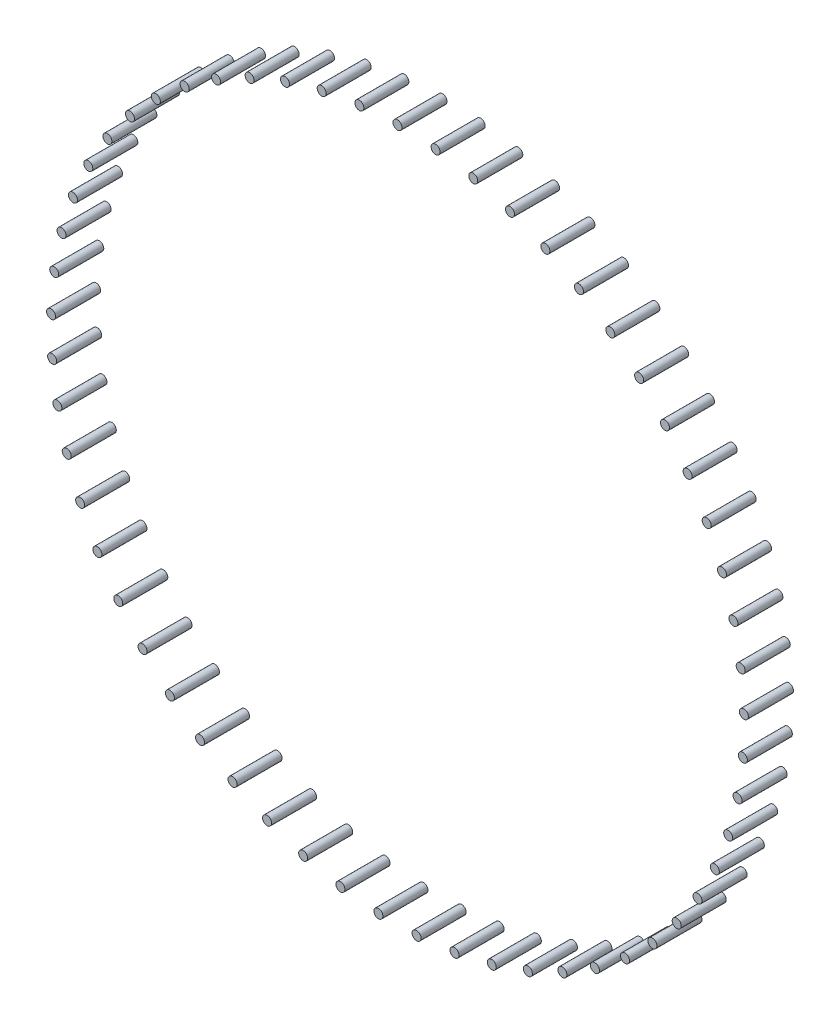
ISO-10303-21;
HEADER;
FILE_DESCRIPTION(('STEP AP214'),'2;1');
FILE_NAME('part.step','',(''),(''),'','','');
FILE_SCHEMA(('AUTOMOTIVE_DESIGN { 1 0 10303 214 1 1 1 1 }'));
ENDSEC;
DATA;
#1=APPLICATION_CONTEXT('core data for automotive mechanical design processes');
#2=APPLICATION_PROTOCOL_DEFINITION('international standard','automotive_design',2000,#1);
#3=PRODUCT_CONTEXT('',#1,'mechanical');
#4=PRODUCT('Part','Part','',(#3));
#5=PRODUCT_RELATED_PRODUCT_CATEGORY('part','',(#4));
#6=PRODUCT_DEFINITION_FORMATION('','',#4);
#7=PRODUCT_DEFINITION_CONTEXT('part definition',#1,'design');
#8=PRODUCT_DEFINITION('design','',#6,#7);
#9=PRODUCT_DEFINITION_SHAPE('','',#8);
#10=(LENGTH_UNIT() NAMED_UNIT(*) SI_UNIT(.MILLI.,.METRE.));
#11=(NAMED_UNIT(*) PLANE_ANGLE_UNIT() SI_UNIT($,.RADIAN.));
#12=(NAMED_UNIT(*) SI_UNIT($,.STERADIAN.) SOLID_ANGLE_UNIT());
#13=UNCERTAINTY_MEASURE_WITH_UNIT(LENGTH_MEASURE(1.E-05),#10,'distance_accuracy_value','');
#14=(GEOMETRIC_REPRESENTATION_CONTEXT(3) GLOBAL_UNCERTAINTY_ASSIGNED_CONTEXT((#13)) GLOBAL_UNIT_ASSIGNED_CONTEXT((#10,
#11,#12)) REPRESENTATION_CONTEXT('',''));
#15=CARTESIAN_POINT('',(0.,0.,0.));
#16=DIRECTION('',(0.,0.,1.));
#17=DIRECTION('',(1.,0.,0.));
#18=AXIS2_PLACEMENT_3D('',#15,#16,#17);
#19=CARTESIAN_POINT('',(-65.7263830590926,-161.821917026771,22.71));
#20=DIRECTION('',(0.,0.,-1.));
#21=DIRECTION('',(-1.,0.,0.));
#22=AXIS2_PLACEMENT_3D('',#19,#20,#21);
#23=CYLINDRICAL_SURFACE('',#22,2.26899999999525);
#24=CARTESIAN_POINT('',(-65.7263830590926,-161.821917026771,22.71));
#25=DIRECTION('',(0.,0.,1.));
#26=DIRECTION('',(1.,0.,0.));
#27=AXIS2_PLACEMENT_3D('',#24,#25,#26);
#28=CIRCLE('',#27,2.26899999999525);
#29=CARTESIAN_POINT('',(-63.4573830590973,-161.821917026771,22.71));
#30=VERTEX_POINT('',#29);
#31=EDGE_CURVE('E11',#30,#30,#28,.T.);
#32=ORIENTED_EDGE('',*,*,#31,.F.);
#33=EDGE_LOOP('',(#32));
#34=FACE_BOUND('',#33,.T.);
#35=CARTESIAN_POINT('',(-65.7263830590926,-161.821917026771,0.));
#36=DIRECTION('',(0.,0.,1.));
#37=DIRECTION('',(1.,0.,0.));
#38=AXIS2_PLACEMENT_3D('',#35,#36,#37);
#39=CIRCLE('',#38,2.26899999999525);
#40=CARTESIAN_POINT('',(-63.4573830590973,-161.821917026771,0.));
#41=VERTEX_POINT('',#40);
#42=EDGE_CURVE('E43',#41,#41,#39,.T.);
#43=ORIENTED_EDGE('',*,*,#42,.T.);
#44=EDGE_LOOP('',(#43));
#45=FACE_BOUND('',#44,.T.);
#46=ADVANCED_FACE('F40',(#34,#45),#23,.T.);
#47=CARTESIAN_POINT('',(-65.7263830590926,-161.821917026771,22.71));
#48=DIRECTION('',(0.,0.,1.));
#49=DIRECTION('',(1.,0.,0.));
#50=AXIS2_PLACEMENT_3D('',#47,#48,#49);
#51=PLANE('',#50);
#52=ORIENTED_EDGE('',*,*,#31,.T.);
#53=EDGE_LOOP('',(#52));
#54=FACE_BOUND('',#53,.T.);
#55=ADVANCED_FACE('F55',(#54),#51,.T.);
#56=CARTESIAN_POINT('',(-65.7263830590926,-161.821917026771,0.));
#57=DIRECTION('',(0.,0.,1.));
#58=DIRECTION('',(1.,0.,0.));
#59=AXIS2_PLACEMENT_3D('',#56,#57,#58);
#60=PLANE('',#59);
#61=ORIENTED_EDGE('',*,*,#42,.F.);
#62=EDGE_LOOP('',(#61));
#63=FACE_BOUND('',#62,.T.);
#64=ADVANCED_FACE('F53',(#63),#60,.F.);
#65=CLOSED_SHELL('',(#46,#55,#64));
#66=MANIFOLD_SOLID_BREP('B2',#65);
#67=CARTESIAN_POINT('',(-47.5257272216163,-168.070210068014,22.71));
#68=DIRECTION('',(0.,0.,-1.));
#69=DIRECTION('',(-1.,0.,0.));
#70=AXIS2_PLACEMENT_3D('',#67,#68,#69);
#71=CYLINDRICAL_SURFACE('',#70,2.26899999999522);
#72=CARTESIAN_POINT('',(-47.5257272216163,-168.070210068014,22.71));
#73=DIRECTION('',(0.,0.,1.));
#74=DIRECTION('',(1.,0.,0.));
#75=AXIS2_PLACEMENT_3D('',#72,#73,#74);
#76=CIRCLE('',#75,2.26899999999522);
#77=CARTESIAN_POINT('',(-45.2567272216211,-168.070210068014,22.71));
#78=VERTEX_POINT('',#77);
#79=EDGE_CURVE('E39',#78,#78,#76,.T.);
#80=ORIENTED_EDGE('',*,*,#79,.F.);
#81=EDGE_LOOP('',(#80));
#82=FACE_BOUND('',#81,.T.);
#83=CARTESIAN_POINT('',(-47.5257272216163,-168.070210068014,0.));
#84=DIRECTION('',(0.,0.,1.));
#85=DIRECTION('',(1.,0.,0.));
#86=AXIS2_PLACEMENT_3D('',#83,#84,#85);
#87=CIRCLE('',#86,2.26899999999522);
#88=CARTESIAN_POINT('',(-45.2567272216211,-168.070210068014,0.));
#89=VERTEX_POINT('',#88);
#90=EDGE_CURVE('E92',#89,#89,#87,.T.);
#91=ORIENTED_EDGE('',*,*,#90,.T.);
#92=EDGE_LOOP('',(#91));
#93=FACE_BOUND('',#92,.T.);
#94=ADVANCED_FACE('F89',(#82,#93),#71,.T.);
#95=CARTESIAN_POINT('',(-47.5257272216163,-168.070210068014,22.71));
#96=DIRECTION('',(0.,0.,1.));
#97=DIRECTION('',(1.,0.,0.));
#98=AXIS2_PLACEMENT_3D('',#95,#96,#97);
#99=PLANE('',#98);
#100=ORIENTED_EDGE('',*,*,#79,.T.);
#101=EDGE_LOOP('',(#100));
#102=FACE_BOUND('',#101,.T.);
#103=ADVANCED_FACE('F104',(#102),#99,.T.);
#104=CARTESIAN_POINT('',(-47.5257272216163,-168.070210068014,0.));
#105=DIRECTION('',(0.,0.,1.));
#106=DIRECTION('',(1.,0.,0.));
#107=AXIS2_PLACEMENT_3D('',#104,#105,#106);
#108=PLANE('',#107);
#109=ORIENTED_EDGE('',*,*,#90,.F.);
#110=EDGE_LOOP('',(#109));
#111=FACE_BOUND('',#110,.T.);
#112=ADVANCED_FACE('F102',(#111),#108,.F.);
#113=CLOSED_SHELL('',(#94,#103,#112));
#114=MANIFOLD_SOLID_BREP('B6',#113);
#115=CARTESIAN_POINT('',(-28.7481734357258,-172.278358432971,22.71));
#116=DIRECTION('',(0.,0.,-1.));
#117=DIRECTION('',(-1.,0.,0.));
#118=AXIS2_PLACEMENT_3D('',#115,#116,#117);
#119=CYLINDRICAL_SURFACE('',#118,2.26899999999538);
#120=CARTESIAN_POINT('',(-28.7481734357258,-172.278358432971,22.71));
#121=DIRECTION('',(0.,0.,1.));
#122=DIRECTION('',(1.,0.,0.));
#123=AXIS2_PLACEMENT_3D('',#120,#121,#122);
#124=CIRCLE('',#123,2.26899999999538);
#125=CARTESIAN_POINT('',(-26.4791734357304,-172.278358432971,22.71));
#126=VERTEX_POINT('',#125);
#127=EDGE_CURVE('E88',#126,#126,#124,.T.);
#128=ORIENTED_EDGE('',*,*,#127,.F.);
#129=EDGE_LOOP('',(#128));
#130=FACE_BOUND('',#129,.T.);
#131=CARTESIAN_POINT('',(-28.7481734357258,-172.278358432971,0.));
#132=DIRECTION('',(0.,0.,1.));
#133=DIRECTION('',(1.,0.,0.));
#134=AXIS2_PLACEMENT_3D('',#131,#132,#133);
#135=CIRCLE('',#134,2.26899999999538);
#136=CARTESIAN_POINT('',(-26.4791734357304,-172.278358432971,0.));
#137=VERTEX_POINT('',#136);
#138=EDGE_CURVE('E141',#137,#137,#135,.T.);
#139=ORIENTED_EDGE('',*,*,#138,.T.);
#140=EDGE_LOOP('',(#139));
#141=FACE_BOUND('',#140,.T.);
#142=ADVANCED_FACE('F138',(#130,#141),#119,.T.);
#143=CARTESIAN_POINT('',(-28.7481734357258,-172.278358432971,22.71));
#144=DIRECTION('',(0.,0.,1.));
#145=DIRECTION('',(1.,0.,0.));
#146=AXIS2_PLACEMENT_3D('',#143,#144,#145);
#147=PLANE('',#146);
#148=ORIENTED_EDGE('',*,*,#127,.T.);
#149=EDGE_LOOP('',(#148));
#150=FACE_BOUND('',#149,.T.);
#151=ADVANCED_FACE('F153',(#150),#147,.T.);
#152=CARTESIAN_POINT('',(-28.7481734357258,-172.278358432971,0.));
#153=DIRECTION('',(0.,0.,1.));
#154=DIRECTION('',(1.,0.,0.));
#155=AXIS2_PLACEMENT_3D('',#152,#153,#154);
#156=PLANE('',#155);
#157=ORIENTED_EDGE('',*,*,#138,.F.);
#158=EDGE_LOOP('',(#157));
#159=FACE_BOUND('',#158,.T.);
#160=ADVANCED_FACE('F151',(#159),#156,.F.);
#161=CLOSED_SHELL('',(#142,#151,#160));
#162=MANIFOLD_SOLID_BREP('B34',#161);
#163=CARTESIAN_POINT('',(-9.62165576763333,-174.395280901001,22.71));
#164=DIRECTION('',(0.,0.,-1.));
#165=DIRECTION('',(-1.,0.,0.));
#166=AXIS2_PLACEMENT_3D('',#163,#164,#165);
#167=CYLINDRICAL_SURFACE('',#166,2.26899999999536);
#168=CARTESIAN_POINT('',(-9.62165576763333,-174.395280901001,22.71));
#169=DIRECTION('',(0.,0.,1.));
#170=DIRECTION('',(1.,0.,0.));
#171=AXIS2_PLACEMENT_3D('',#168,#169,#170);
#172=CIRCLE('',#171,2.26899999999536);
#173=CARTESIAN_POINT('',(-7.35265576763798,-174.395280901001,22.71));
#174=VERTEX_POINT('',#173);
#175=EDGE_CURVE('E137',#174,#174,#172,.T.);
#176=ORIENTED_EDGE('',*,*,#175,.F.);
#177=EDGE_LOOP('',(#176));
#178=FACE_BOUND('',#177,.T.);
#179=CARTESIAN_POINT('',(-9.62165576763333,-174.395280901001,0.));
#180=DIRECTION('',(0.,0.,1.));
#181=DIRECTION('',(1.,0.,0.));
#182=AXIS2_PLACEMENT_3D('',#179,#180,#181);
#183=CIRCLE('',#182,2.26899999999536);
#184=CARTESIAN_POINT('',(-7.35265576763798,-174.395280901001,0.));
#185=VERTEX_POINT('',#184);
#186=EDGE_CURVE('E190',#185,#185,#183,.T.);
#187=ORIENTED_EDGE('',*,*,#186,.T.);
#188=EDGE_LOOP('',(#187));
#189=FACE_BOUND('',#188,.T.);
#190=ADVANCED_FACE('F187',(#178,#189),#167,.T.);
#191=CARTESIAN_POINT('',(-9.62165576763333,-174.395280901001,22.71));
#192=DIRECTION('',(0.,0.,1.));
#193=DIRECTION('',(1.,0.,0.));
#194=AXIS2_PLACEMENT_3D('',#191,#192,#193);
#195=PLANE('',#194);
#196=ORIENTED_EDGE('',*,*,#175,.T.);
#197=EDGE_LOOP('',(#196));
#198=FACE_BOUND('',#197,.T.);
#199=ADVANCED_FACE('F202',(#198),#195,.T.);
#200=CARTESIAN_POINT('',(-9.62165576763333,-174.395280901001,0.));
#201=DIRECTION('',(0.,0.,1.));
#202=DIRECTION('',(1.,0.,0.));
#203=AXIS2_PLACEMENT_3D('',#200,#201,#202);
#204=PLANE('',#203);
#205=ORIENTED_EDGE('',*,*,#186,.F.);
#206=EDGE_LOOP('',(#205));
#207=FACE_BOUND('',#206,.T.);
#208=ADVANCED_FACE('F200',(#207),#204,.F.);
#209=CLOSED_SHELL('',(#190,#199,#208));
#210=MANIFOLD_SOLID_BREP('B83',#209);
#211=CARTESIAN_POINT('',(9.62165576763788,-174.395280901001,22.71));
#212=DIRECTION('',(0.,0.,-1.));
#213=DIRECTION('',(-1.,0.,0.));
#214=AXIS2_PLACEMENT_3D('',#211,#212,#213);
#215=CYLINDRICAL_SURFACE('',#214,2.26899999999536);
#216=CARTESIAN_POINT('',(9.62165576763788,-174.395280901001,22.71));
#217=DIRECTION('',(0.,0.,1.));
#218=DIRECTION('',(1.,0.,0.));
#219=AXIS2_PLACEMENT_3D('',#216,#217,#218);
#220=CIRCLE('',#219,2.26899999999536);
#221=CARTESIAN_POINT('',(11.8906557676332,-174.395280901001,22.71));
#222=VERTEX_POINT('',#221);
#223=EDGE_CURVE('E186',#222,#222,#220,.T.);
#224=ORIENTED_EDGE('',*,*,#223,.F.);
#225=EDGE_LOOP('',(#224));
#226=FACE_BOUND('',#225,.T.);
#227=CARTESIAN_POINT('',(9.62165576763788,-174.395280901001,0.));
#228=DIRECTION('',(0.,0.,1.));
#229=DIRECTION('',(1.,0.,0.));
#230=AXIS2_PLACEMENT_3D('',#227,#228,#229);
#231=CIRCLE('',#230,2.26899999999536);
#232=CARTESIAN_POINT('',(11.8906557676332,-174.395280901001,0.));
#233=VERTEX_POINT('',#232);
#234=EDGE_CURVE('E239',#233,#233,#231,.T.);
#235=ORIENTED_EDGE('',*,*,#234,.T.);
#236=EDGE_LOOP('',(#235));
#237=FACE_BOUND('',#236,.T.);
#238=ADVANCED_FACE('F236',(#226,#237),#215,.T.);
#239=CARTESIAN_POINT('',(9.62165576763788,-174.395280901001,22.71));
#240=DIRECTION('',(0.,0.,1.));
#241=DIRECTION('',(1.,0.,0.));
#242=AXIS2_PLACEMENT_3D('',#239,#240,#241);
#243=PLANE('',#242);
#244=ORIENTED_EDGE('',*,*,#223,.T.);
#245=EDGE_LOOP('',(#244));
#246=FACE_BOUND('',#245,.T.);
#247=ADVANCED_FACE('F251',(#246),#243,.T.);
#248=CARTESIAN_POINT('',(9.62165576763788,-174.395280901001,0.));
#249=DIRECTION('',(0.,0.,1.));
#250=DIRECTION('',(1.,0.,0.));
#251=AXIS2_PLACEMENT_3D('',#248,#249,#250);
#252=PLANE('',#251);
#253=ORIENTED_EDGE('',*,*,#234,.F.);
#254=EDGE_LOOP('',(#253));
#255=FACE_BOUND('',#254,.T.);
#256=ADVANCED_FACE('F249',(#255),#252,.F.);
#257=CLOSED_SHELL('',(#238,#247,#256));
#258=MANIFOLD_SOLID_BREP('B132',#257);
#259=CARTESIAN_POINT('',(28.7481734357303,-172.27835843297,22.71));
#260=DIRECTION('',(0.,0.,-1.));
#261=DIRECTION('',(-1.,0.,0.));
#262=AXIS2_PLACEMENT_3D('',#259,#260,#261);
#263=CYLINDRICAL_SURFACE('',#262,2.26899999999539);
#264=CARTESIAN_POINT('',(28.7481734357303,-172.27835843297,22.71));
#265=DIRECTION('',(0.,0.,1.));
#266=DIRECTION('',(1.,0.,0.));
#267=AXIS2_PLACEMENT_3D('',#264,#265,#266);
#268=CIRCLE('',#267,2.26899999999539);
#269=CARTESIAN_POINT('',(31.0171734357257,-172.27835843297,22.71));
#270=VERTEX_POINT('',#269);
#271=EDGE_CURVE('E235',#270,#270,#268,.T.);
#272=ORIENTED_EDGE('',*,*,#271,.F.);
#273=EDGE_LOOP('',(#272));
#274=FACE_BOUND('',#273,.T.);
#275=CARTESIAN_POINT('',(28.7481734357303,-172.27835843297,0.));
#276=DIRECTION('',(0.,0.,1.));
#277=DIRECTION('',(1.,0.,0.));
#278=AXIS2_PLACEMENT_3D('',#275,#276,#277);
#279=CIRCLE('',#278,2.26899999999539);
#280=CARTESIAN_POINT('',(31.0171734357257,-172.27835843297,0.));
#281=VERTEX_POINT('',#280);
#282=EDGE_CURVE('E288',#281,#281,#279,.T.);
#283=ORIENTED_EDGE('',*,*,#282,.T.);
#284=EDGE_LOOP('',(#283));
#285=FACE_BOUND('',#284,.T.);
#286=ADVANCED_FACE('F285',(#274,#285),#263,.T.);
#287=CARTESIAN_POINT('',(28.7481734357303,-172.27835843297,22.71));
#288=DIRECTION('',(0.,0.,1.));
#289=DIRECTION('',(1.,0.,0.));
#290=AXIS2_PLACEMENT_3D('',#287,#288,#289);
#291=PLANE('',#290);
#292=ORIENTED_EDGE('',*,*,#271,.T.);
#293=EDGE_LOOP('',(#292));
#294=FACE_BOUND('',#293,.T.);
#295=ADVANCED_FACE('F300',(#294),#291,.T.);
#296=CARTESIAN_POINT('',(28.7481734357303,-172.27835843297,0.));
#297=DIRECTION('',(0.,0.,1.));
#298=DIRECTION('',(1.,0.,0.));
#299=AXIS2_PLACEMENT_3D('',#296,#297,#298);
#300=PLANE('',#299);
#301=ORIENTED_EDGE('',*,*,#282,.F.);
#302=EDGE_LOOP('',(#301));
#303=FACE_BOUND('',#302,.T.);
#304=ADVANCED_FACE('F298',(#303),#300,.F.);
#305=CLOSED_SHELL('',(#286,#295,#304));
#306=MANIFOLD_SOLID_BREP('B181',#305);
#307=CARTESIAN_POINT('',(47.5257272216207,-168.070210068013,22.71));
#308=DIRECTION('',(0.,0.,-1.));
#309=DIRECTION('',(-1.,0.,0.));
#310=AXIS2_PLACEMENT_3D('',#307,#308,#309);
#311=CYLINDRICAL_SURFACE('',#310,2.26899999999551);
#312=CARTESIAN_POINT('',(47.5257272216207,-168.070210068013,22.71));
#313=DIRECTION('',(0.,0.,1.));
#314=DIRECTION('',(1.,0.,0.));
#315=AXIS2_PLACEMENT_3D('',#312,#313,#314);
#316=CIRCLE('',#315,2.26899999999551);
#317=CARTESIAN_POINT('',(49.7947272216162,-168.070210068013,22.71));
#318=VERTEX_POINT('',#317);
#319=EDGE_CURVE('E284',#318,#318,#316,.T.);
#320=ORIENTED_EDGE('',*,*,#319,.F.);
#321=EDGE_LOOP('',(#320));
#322=FACE_BOUND('',#321,.T.);
#323=CARTESIAN_POINT('',(47.5257272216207,-168.070210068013,0.));
#324=DIRECTION('',(0.,0.,1.));
#325=DIRECTION('',(1.,0.,0.));
#326=AXIS2_PLACEMENT_3D('',#323,#324,#325);
#327=CIRCLE('',#326,2.26899999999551);
#328=CARTESIAN_POINT('',(49.7947272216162,-168.070210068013,0.));
#329=VERTEX_POINT('',#328);
#330=EDGE_CURVE('E337',#329,#329,#327,.T.);
#331=ORIENTED_EDGE('',*,*,#330,.T.);
#332=EDGE_LOOP('',(#331));
#333=FACE_BOUND('',#332,.T.);
#334=ADVANCED_FACE('F334',(#322,#333),#311,.T.);
#335=CARTESIAN_POINT('',(47.5257272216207,-168.070210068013,22.71));
#336=DIRECTION('',(0.,0.,1.));
#337=DIRECTION('',(1.,0.,0.));
#338=AXIS2_PLACEMENT_3D('',#335,#336,#337);
#339=PLANE('',#338);
#340=ORIENTED_EDGE('',*,*,#319,.T.);
#341=EDGE_LOOP('',(#340));
#342=FACE_BOUND('',#341,.T.);
#343=ADVANCED_FACE('F349',(#342),#339,.T.);
#344=CARTESIAN_POINT('',(47.5257272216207,-168.070210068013,0.));
#345=DIRECTION('',(0.,0.,1.));
#346=DIRECTION('',(1.,0.,0.));
#347=AXIS2_PLACEMENT_3D('',#344,#345,#346);
#348=PLANE('',#347);
#349=ORIENTED_EDGE('',*,*,#330,.F.);
#350=EDGE_LOOP('',(#349));
#351=FACE_BOUND('',#350,.T.);
#352=ADVANCED_FACE('F347',(#351),#348,.F.);
#353=CLOSED_SHELL('',(#334,#343,#352));
#354=MANIFOLD_SOLID_BREP('B230',#353);
#355=CARTESIAN_POINT('',(65.7263830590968,-161.82191702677,22.71));
#356=DIRECTION('',(0.,0.,-1.));
#357=DIRECTION('',(-1.,0.,0.));
#358=AXIS2_PLACEMENT_3D('',#355,#356,#357);
#359=CYLINDRICAL_SURFACE('',#358,2.26899999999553);
#360=CARTESIAN_POINT('',(65.7263830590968,-161.82191702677,22.71));
#361=DIRECTION('',(0.,0.,1.));
#362=DIRECTION('',(1.,0.,0.));
#363=AXIS2_PLACEMENT_3D('',#360,#361,#362);
#364=CIRCLE('',#363,2.26899999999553);
#365=CARTESIAN_POINT('',(67.9953830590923,-161.82191702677,22.71));
#366=VERTEX_POINT('',#365);
#367=EDGE_CURVE('E333',#366,#366,#364,.T.);
#368=ORIENTED_EDGE('',*,*,#367,.F.);
#369=EDGE_LOOP('',(#368));
#370=FACE_BOUND('',#369,.T.);
#371=CARTESIAN_POINT('',(65.7263830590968,-161.82191702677,0.));
#372=DIRECTION('',(0.,0.,1.));
#373=DIRECTION('',(1.,0.,0.));
#374=AXIS2_PLACEMENT_3D('',#371,#372,#373);
#375=CIRCLE('',#374,2.26899999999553);
#376=CARTESIAN_POINT('',(67.9953830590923,-161.82191702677,0.));
#377=VERTEX_POINT('',#376);
#378=EDGE_CURVE('E386',#377,#377,#375,.T.);
#379=ORIENTED_EDGE('',*,*,#378,.T.);
#380=EDGE_LOOP('',(#379));
#381=FACE_BOUND('',#380,.T.);
#382=ADVANCED_FACE('F383',(#370,#381),#359,.T.);
#383=CARTESIAN_POINT('',(65.7263830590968,-161.82191702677,22.71));
#384=DIRECTION('',(0.,0.,1.));
#385=DIRECTION('',(1.,0.,0.));
#386=AXIS2_PLACEMENT_3D('',#383,#384,#385);
#387=PLANE('',#386);
#388=ORIENTED_EDGE('',*,*,#367,.T.);
#389=EDGE_LOOP('',(#388));
#390=FACE_BOUND('',#389,.T.);
#391=ADVANCED_FACE('F398',(#390),#387,.T.);
#392=CARTESIAN_POINT('',(65.7263830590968,-161.82191702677,0.));
#393=DIRECTION('',(0.,0.,1.));
#394=DIRECTION('',(1.,0.,0.));
#395=AXIS2_PLACEMENT_3D('',#392,#393,#394);
#396=PLANE('',#395);
#397=ORIENTED_EDGE('',*,*,#378,.F.);
#398=EDGE_LOOP('',(#397));
#399=FACE_BOUND('',#398,.T.);
#400=ADVANCED_FACE('F396',(#399),#396,.F.);
#401=CLOSED_SHELL('',(#382,#391,#400));
#402=MANIFOLD_SOLID_BREP('B279',#401);
#403=CARTESIAN_POINT('',(83.1292096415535,-153.609325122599,22.71));
#404=DIRECTION('',(0.,0.,-1.));
#405=DIRECTION('',(-1.,0.,0.));
#406=AXIS2_PLACEMENT_3D('',#403,#404,#405);
#407=CYLINDRICAL_SURFACE('',#406,2.26899999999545);
#408=CARTESIAN_POINT('',(83.1292096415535,-153.609325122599,22.71));
#409=DIRECTION('',(0.,0.,1.));
#410=DIRECTION('',(1.,0.,0.));
#411=AXIS2_PLACEMENT_3D('',#408,#409,#410);
#412=CIRCLE('',#411,2.26899999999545);
#413=CARTESIAN_POINT('',(85.398209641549,-153.609325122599,22.71));
#414=VERTEX_POINT('',#413);
#415=EDGE_CURVE('E382',#414,#414,#412,.T.);
#416=ORIENTED_EDGE('',*,*,#415,.F.);
#417=EDGE_LOOP('',(#416));
#418=FACE_BOUND('',#417,.T.);
#419=CARTESIAN_POINT('',(83.1292096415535,-153.609325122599,0.));
#420=DIRECTION('',(0.,0.,1.));
#421=DIRECTION('',(1.,0.,0.));
#422=AXIS2_PLACEMENT_3D('',#419,#420,#421);
#423=CIRCLE('',#422,2.26899999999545);
#424=CARTESIAN_POINT('',(85.398209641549,-153.609325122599,0.));
#425=VERTEX_POINT('',#424);
#426=EDGE_CURVE('E435',#425,#425,#423,.T.);
#427=ORIENTED_EDGE('',*,*,#426,.T.);
#428=EDGE_LOOP('',(#427));
#429=FACE_BOUND('',#428,.T.);
#430=ADVANCED_FACE('F432',(#418,#429),#407,.T.);
#431=CARTESIAN_POINT('',(83.1292096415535,-153.609325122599,22.71));
#432=DIRECTION('',(0.,0.,1.));
#433=DIRECTION('',(1.,0.,0.));
#434=AXIS2_PLACEMENT_3D('',#431,#432,#433);
#435=PLANE('',#434);
#436=ORIENTED_EDGE('',*,*,#415,.T.);
#437=EDGE_LOOP('',(#436));
#438=FACE_BOUND('',#437,.T.);
#439=ADVANCED_FACE('F447',(#438),#435,.T.);
#440=CARTESIAN_POINT('',(83.1292096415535,-153.609325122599,0.));
#441=DIRECTION('',(0.,0.,1.));
#442=DIRECTION('',(1.,0.,0.));
#443=AXIS2_PLACEMENT_3D('',#440,#441,#442);
#444=PLANE('',#443);
#445=ORIENTED_EDGE('',*,*,#426,.F.);
#446=EDGE_LOOP('',(#445));
#447=FACE_BOUND('',#446,.T.);
#448=ADVANCED_FACE('F445',(#447),#444,.F.);
#449=CLOSED_SHELL('',(#430,#439,#448));
#450=MANIFOLD_SOLID_BREP('B328',#449);
#451=CARTESIAN_POINT('',(99.5229602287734,-143.532124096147,22.71));
#452=DIRECTION('',(0.,0.,-1.));
#453=DIRECTION('',(-1.,0.,0.));
#454=AXIS2_PLACEMENT_3D('',#451,#452,#453);
#455=CYLINDRICAL_SURFACE('',#454,2.26899999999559);
#456=CARTESIAN_POINT('',(99.5229602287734,-143.532124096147,22.71));
#457=DIRECTION('',(0.,0.,1.));
#458=DIRECTION('',(1.,0.,0.));
#459=AXIS2_PLACEMENT_3D('',#456,#457,#458);
#460=CIRCLE('',#459,2.26899999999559);
#461=CARTESIAN_POINT('',(101.791960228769,-143.532124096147,22.71));
#462=VERTEX_POINT('',#461);
#463=EDGE_CURVE('E431',#462,#462,#460,.T.);
#464=ORIENTED_EDGE('',*,*,#463,.F.);
#465=EDGE_LOOP('',(#464));
#466=FACE_BOUND('',#465,.T.);
#467=CARTESIAN_POINT('',(99.5229602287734,-143.532124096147,0.));
#468=DIRECTION('',(0.,0.,1.));
#469=DIRECTION('',(1.,0.,0.));
#470=AXIS2_PLACEMENT_3D('',#467,#468,#469);
#471=CIRCLE('',#470,2.26899999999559);
#472=CARTESIAN_POINT('',(101.791960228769,-143.532124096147,0.));
#473=VERTEX_POINT('',#472);
#474=EDGE_CURVE('E484',#473,#473,#471,.T.);
#475=ORIENTED_EDGE('',*,*,#474,.T.);
#476=EDGE_LOOP('',(#475));
#477=FACE_BOUND('',#476,.T.);
#478=ADVANCED_FACE('F481',(#466,#477),#455,.T.);
#479=CARTESIAN_POINT('',(99.5229602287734,-143.532124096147,22.71));
#480=DIRECTION('',(0.,0.,1.));
#481=DIRECTION('',(1.,0.,0.));
#482=AXIS2_PLACEMENT_3D('',#479,#480,#481);
#483=PLANE('',#482);
#484=ORIENTED_EDGE('',*,*,#463,.T.);
#485=EDGE_LOOP('',(#484));
#486=FACE_BOUND('',#485,.T.);
#487=ADVANCED_FACE('F496',(#486),#483,.T.);
#488=CARTESIAN_POINT('',(99.5229602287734,-143.532124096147,0.));
#489=DIRECTION('',(0.,0.,1.));
#490=DIRECTION('',(1.,0.,0.));
#491=AXIS2_PLACEMENT_3D('',#488,#489,#490);
#492=PLANE('',#491);
#493=ORIENTED_EDGE('',*,*,#474,.F.);
#494=EDGE_LOOP('',(#493));
#495=FACE_BOUND('',#494,.T.);
#496=ADVANCED_FACE('F494',(#495),#492,.F.);
#497=CLOSED_SHELL('',(#478,#487,#496));
#498=MANIFOLD_SOLID_BREP('B377',#497);
#499=CARTESIAN_POINT('',(114.708636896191,-131.712637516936,22.71));
#500=DIRECTION('',(0.,0.,-1.));
#501=DIRECTION('',(-1.,0.,0.));
#502=AXIS2_PLACEMENT_3D('',#499,#500,#501);
#503=CYLINDRICAL_SURFACE('',#502,2.26899999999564);
#504=CARTESIAN_POINT('',(114.708636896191,-131.712637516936,22.71));
#505=DIRECTION('',(0.,0.,1.));
#506=DIRECTION('',(1.,0.,0.));
#507=AXIS2_PLACEMENT_3D('',#504,#505,#506);
#508=CIRCLE('',#507,2.26899999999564);
#509=CARTESIAN_POINT('',(116.977636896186,-131.712637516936,22.71));
#510=VERTEX_POINT('',#509);
#511=EDGE_CURVE('E480',#510,#510,#508,.T.);
#512=ORIENTED_EDGE('',*,*,#511,.F.);
#513=EDGE_LOOP('',(#512));
#514=FACE_BOUND('',#513,.T.);
#515=CARTESIAN_POINT('',(114.708636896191,-131.712637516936,0.));
#516=DIRECTION('',(0.,0.,1.));
#517=DIRECTION('',(1.,0.,0.));
#518=AXIS2_PLACEMENT_3D('',#515,#516,#517);
#519=CIRCLE('',#518,2.26899999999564);
#520=CARTESIAN_POINT('',(116.977636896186,-131.712637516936,0.));
#521=VERTEX_POINT('',#520);
#522=EDGE_CURVE('E533',#521,#521,#519,.T.);
#523=ORIENTED_EDGE('',*,*,#522,.T.);
#524=EDGE_LOOP('',(#523));
#525=FACE_BOUND('',#524,.T.);
#526=ADVANCED_FACE('F530',(#514,#525),#503,.T.);
#527=CARTESIAN_POINT('',(114.708636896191,-131.712637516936,22.71));
#528=DIRECTION('',(0.,0.,1.));
#529=DIRECTION('',(1.,0.,0.));
#530=AXIS2_PLACEMENT_3D('',#527,#528,#529);
#531=PLANE('',#530);
#532=ORIENTED_EDGE('',*,*,#511,.T.);
#533=EDGE_LOOP('',(#532));
#534=FACE_BOUND('',#533,.T.);
#535=ADVANCED_FACE('F545',(#534),#531,.T.);
#536=CARTESIAN_POINT('',(114.708636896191,-131.712637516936,0.));
#537=DIRECTION('',(0.,0.,1.));
#538=DIRECTION('',(1.,0.,0.));
#539=AXIS2_PLACEMENT_3D('',#536,#537,#538);
#540=PLANE('',#539);
#541=ORIENTED_EDGE('',*,*,#522,.F.);
#542=EDGE_LOOP('',(#541));
#543=FACE_BOUND('',#542,.T.);
#544=ADVANCED_FACE('F543',(#543),#540,.F.);
#545=CLOSED_SHELL('',(#526,#535,#544));
#546=MANIFOLD_SOLID_BREP('B426',#545);
#547=CARTESIAN_POINT('',(128.501906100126,-118.294337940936,22.71));
#548=DIRECTION('',(0.,0.,-1.));
#549=DIRECTION('',(-1.,0.,0.));
#550=AXIS2_PLACEMENT_3D('',#547,#548,#549);
#551=CYLINDRICAL_SURFACE('',#550,2.26899999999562);
#552=CARTESIAN_POINT('',(128.501906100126,-118.294337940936,22.71));
#553=DIRECTION('',(0.,0.,1.));
#554=DIRECTION('',(1.,0.,0.));
#555=AXIS2_PLACEMENT_3D('',#552,#553,#554);
#556=CIRCLE('',#555,2.26899999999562);
#557=CARTESIAN_POINT('',(130.770906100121,-118.294337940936,22.71));
#558=VERTEX_POINT('',#557);
#559=EDGE_CURVE('E529',#558,#558,#556,.T.);
#560=ORIENTED_EDGE('',*,*,#559,.F.);
#561=EDGE_LOOP('',(#560));
#562=FACE_BOUND('',#561,.T.);
#563=CARTESIAN_POINT('',(128.501906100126,-118.294337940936,0.));
#564=DIRECTION('',(0.,0.,1.));
#565=DIRECTION('',(1.,0.,0.));
#566=AXIS2_PLACEMENT_3D('',#563,#564,#565);
#567=CIRCLE('',#566,2.26899999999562);
#568=CARTESIAN_POINT('',(130.770906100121,-118.294337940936,0.));
#569=VERTEX_POINT('',#568);
#570=EDGE_CURVE('E582',#569,#569,#567,.T.);
#571=ORIENTED_EDGE('',*,*,#570,.T.);
#572=EDGE_LOOP('',(#571));
#573=FACE_BOUND('',#572,.T.);
#574=ADVANCED_FACE('F579',(#562,#573),#551,.T.);
#575=CARTESIAN_POINT('',(128.501906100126,-118.294337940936,22.71));
#576=DIRECTION('',(0.,0.,1.));
#577=DIRECTION('',(1.,0.,0.));
#578=AXIS2_PLACEMENT_3D('',#575,#576,#577);
#579=PLANE('',#578);
#580=ORIENTED_EDGE('',*,*,#559,.T.);
#581=EDGE_LOOP('',(#580));
#582=FACE_BOUND('',#581,.T.);
#583=ADVANCED_FACE('F594',(#582),#579,.T.);
#584=CARTESIAN_POINT('',(128.501906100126,-118.294337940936,0.));
#585=DIRECTION('',(0.,0.,1.));
#586=DIRECTION('',(1.,0.,0.));
#587=AXIS2_PLACEMENT_3D('',#584,#585,#586);
#588=PLANE('',#587);
#589=ORIENTED_EDGE('',*,*,#570,.F.);
#590=EDGE_LOOP('',(#589));
#591=FACE_BOUND('',#590,.T.);
#592=ADVANCED_FACE('F592',(#591),#588,.F.);
#593=CLOSED_SHELL('',(#574,#583,#592));
#594=MANIFOLD_SOLID_BREP('B475',#593);
#595=CARTESIAN_POINT('',(140.7353362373,-103.44010534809,22.71));
#596=DIRECTION('',(0.,0.,-1.));
#597=DIRECTION('',(-1.,0.,0.));
#598=AXIS2_PLACEMENT_3D('',#595,#596,#597);
#599=CYLINDRICAL_SURFACE('',#598,2.26899999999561);
#600=CARTESIAN_POINT('',(140.7353362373,-103.44010534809,22.71));
#601=DIRECTION('',(0.,0.,1.));
#602=DIRECTION('',(1.,0.,0.));
#603=AXIS2_PLACEMENT_3D('',#600,#601,#602);
#604=CIRCLE('',#603,2.26899999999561);
#605=CARTESIAN_POINT('',(143.004336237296,-103.44010534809,22.71));
#606=VERTEX_POINT('',#605);
#607=EDGE_CURVE('E578',#606,#606,#604,.T.);
#608=ORIENTED_EDGE('',*,*,#607,.F.);
#609=EDGE_LOOP('',(#608));
#610=FACE_BOUND('',#609,.T.);
#611=CARTESIAN_POINT('',(140.7353362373,-103.44010534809,0.));
#612=DIRECTION('',(0.,0.,1.));
#613=DIRECTION('',(1.,0.,0.));
#614=AXIS2_PLACEMENT_3D('',#611,#612,#613);
#615=CIRCLE('',#614,2.26899999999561);
#616=CARTESIAN_POINT('',(143.004336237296,-103.44010534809,0.));
#617=VERTEX_POINT('',#616);
#618=EDGE_CURVE('E631',#617,#617,#615,.T.);
#619=ORIENTED_EDGE('',*,*,#618,.T.);
#620=EDGE_LOOP('',(#619));
#621=FACE_BOUND('',#620,.T.);
#622=ADVANCED_FACE('F628',(#610,#621),#599,.T.);
#623=CARTESIAN_POINT('',(140.7353362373,-103.44010534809,22.71));
#624=DIRECTION('',(0.,0.,1.));
#625=DIRECTION('',(1.,0.,0.));
#626=AXIS2_PLACEMENT_3D('',#623,#624,#625);
#627=PLANE('',#626);
#628=ORIENTED_EDGE('',*,*,#607,.T.);
#629=EDGE_LOOP('',(#628));
#630=FACE_BOUND('',#629,.T.);
#631=ADVANCED_FACE('F643',(#630),#627,.T.);
#632=CARTESIAN_POINT('',(140.7353362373,-103.44010534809,0.));
#633=DIRECTION('',(0.,0.,1.));
#634=DIRECTION('',(1.,0.,0.));
#635=AXIS2_PLACEMENT_3D('',#632,#633,#634);
#636=PLANE('',#635);
#637=ORIENTED_EDGE('',*,*,#618,.F.);
#638=EDGE_LOOP('',(#637));
#639=FACE_BOUND('',#638,.T.);
#640=ADVANCED_FACE('F641',(#639),#636,.F.);
#641=CLOSED_SHELL('',(#622,#631,#640));
#642=MANIFOLD_SOLID_BREP('B524',#641);
#643=CARTESIAN_POINT('',(151.260430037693,-87.3302499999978,22.71));
#644=DIRECTION('',(0.,0.,-1.));
#645=DIRECTION('',(-1.,0.,0.));
#646=AXIS2_PLACEMENT_3D('',#643,#644,#645);
#647=CYLINDRICAL_SURFACE('',#646,2.26899999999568);
#648=CARTESIAN_POINT('',(151.260430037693,-87.3302499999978,22.71));
#649=DIRECTION('',(0.,0.,1.));
#650=DIRECTION('',(1.,0.,0.));
#651=AXIS2_PLACEMENT_3D('',#648,#649,#650);
#652=CIRCLE('',#651,2.26899999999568);
#653=CARTESIAN_POINT('',(153.529430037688,-87.3302499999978,22.71));
#654=VERTEX_POINT('',#653);
#655=EDGE_CURVE('E627',#654,#654,#652,.T.);
#656=ORIENTED_EDGE('',*,*,#655,.F.);
#657=EDGE_LOOP('',(#656));
#658=FACE_BOUND('',#657,.T.);
#659=CARTESIAN_POINT('',(151.260430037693,-87.3302499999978,0.));
#660=DIRECTION('',(0.,0.,1.));
#661=DIRECTION('',(1.,0.,0.));
#662=AXIS2_PLACEMENT_3D('',#659,#660,#661);
#663=CIRCLE('',#662,2.26899999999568);
#664=CARTESIAN_POINT('',(153.529430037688,-87.3302499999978,0.));
#665=VERTEX_POINT('',#664);
#666=EDGE_CURVE('E680',#665,#665,#663,.T.);
#667=ORIENTED_EDGE('',*,*,#666,.T.);
#668=EDGE_LOOP('',(#667));
#669=FACE_BOUND('',#668,.T.);
#670=ADVANCED_FACE('F677',(#658,#669),#647,.T.);
#671=CARTESIAN_POINT('',(151.260430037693,-87.3302499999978,22.71));
#672=DIRECTION('',(0.,0.,1.));
#673=DIRECTION('',(1.,0.,0.));
#674=AXIS2_PLACEMENT_3D('',#671,#672,#673);
#675=PLANE('',#674);
#676=ORIENTED_EDGE('',*,*,#655,.T.);
#677=EDGE_LOOP('',(#676));
#678=FACE_BOUND('',#677,.T.);
#679=ADVANCED_FACE('F692',(#678),#675,.T.);
#680=CARTESIAN_POINT('',(151.260430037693,-87.3302499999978,0.));
#681=DIRECTION('',(0.,0.,1.));
#682=DIRECTION('',(1.,0.,0.));
#683=AXIS2_PLACEMENT_3D('',#680,#681,#682);
#684=PLANE('',#683);
#685=ORIENTED_EDGE('',*,*,#666,.F.);
#686=EDGE_LOOP('',(#685));
#687=FACE_BOUND('',#686,.T.);
#688=ADVANCED_FACE('F690',(#687),#684,.F.);
#689=CLOSED_SHELL('',(#670,#679,#688));
#690=MANIFOLD_SOLID_BREP('B573',#689);
#691=CARTESIAN_POINT('',(159.949427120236,-70.1603237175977,22.71));
#692=DIRECTION('',(0.,0.,-1.));
#693=DIRECTION('',(-1.,0.,0.));
#694=AXIS2_PLACEMENT_3D('',#691,#692,#693);
#695=CYLINDRICAL_SURFACE('',#694,2.2689999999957);
#696=CARTESIAN_POINT('',(159.949427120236,-70.1603237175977,22.71));
#697=DIRECTION('',(0.,0.,1.));
#698=DIRECTION('',(1.,0.,0.));
#699=AXIS2_PLACEMENT_3D('',#696,#697,#698);
#700=CIRCLE('',#699,2.2689999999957);
#701=CARTESIAN_POINT('',(162.218427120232,-70.1603237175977,22.71));
#702=VERTEX_POINT('',#701);
#703=EDGE_CURVE('E676',#702,#702,#700,.T.);
#704=ORIENTED_EDGE('',*,*,#703,.F.);
#705=EDGE_LOOP('',(#704));
#706=FACE_BOUND('',#705,.T.);
#707=CARTESIAN_POINT('',(159.949427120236,-70.1603237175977,0.));
#708=DIRECTION('',(0.,0.,1.));
#709=DIRECTION('',(1.,0.,0.));
#710=AXIS2_PLACEMENT_3D('',#707,#708,#709);
#711=CIRCLE('',#710,2.2689999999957);
#712=CARTESIAN_POINT('',(162.218427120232,-70.1603237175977,0.));
#713=VERTEX_POINT('',#712);
#714=EDGE_CURVE('E729',#713,#713,#711,.T.);
#715=ORIENTED_EDGE('',*,*,#714,.T.);
#716=EDGE_LOOP('',(#715));
#717=FACE_BOUND('',#716,.T.);
#718=ADVANCED_FACE('F726',(#706,#717),#695,.T.);
#719=CARTESIAN_POINT('',(159.949427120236,-70.1603237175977,22.71));
#720=DIRECTION('',(0.,0.,1.));
#721=DIRECTION('',(1.,0.,0.));
#722=AXIS2_PLACEMENT_3D('',#719,#720,#721);
#723=PLANE('',#722);
#724=ORIENTED_EDGE('',*,*,#703,.T.);
#725=EDGE_LOOP('',(#724));
#726=FACE_BOUND('',#725,.T.);
#727=ADVANCED_FACE('F741',(#726),#723,.T.);
#728=CARTESIAN_POINT('',(159.949427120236,-70.1603237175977,0.));
#729=DIRECTION('',(0.,0.,1.));
#730=DIRECTION('',(1.,0.,0.));
#731=AXIS2_PLACEMENT_3D('',#728,#729,#730);
#732=PLANE('',#731);
#733=ORIENTED_EDGE('',*,*,#714,.F.);
#734=EDGE_LOOP('',(#733));
#735=FACE_BOUND('',#734,.T.);
#736=ADVANCED_FACE('F739',(#735),#732,.F.);
#737=CLOSED_SHELL('',(#718,#727,#736));
#738=MANIFOLD_SOLID_BREP('B622',#737);
#739=CARTESIAN_POINT('',(166.696854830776,-52.1387461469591,22.71));
#740=DIRECTION('',(0.,0.,-1.));
#741=DIRECTION('',(-1.,0.,0.));
#742=AXIS2_PLACEMENT_3D('',#739,#740,#741);
#743=CYLINDRICAL_SURFACE('',#742,2.2689999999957);
#744=CARTESIAN_POINT('',(166.696854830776,-52.1387461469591,22.71));
#745=DIRECTION('',(0.,0.,1.));
#746=DIRECTION('',(1.,0.,0.));
#747=AXIS2_PLACEMENT_3D('',#744,#745,#746);
#748=CIRCLE('',#747,2.2689999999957);
#749=CARTESIAN_POINT('',(168.965854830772,-52.1387461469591,22.71));
#750=VERTEX_POINT('',#749);
#751=EDGE_CURVE('E725',#750,#750,#748,.T.);
#752=ORIENTED_EDGE('',*,*,#751,.F.);
#753=EDGE_LOOP('',(#752));
#754=FACE_BOUND('',#753,.T.);
#755=CARTESIAN_POINT('',(166.696854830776,-52.1387461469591,0.));
#756=DIRECTION('',(0.,0.,1.));
#757=DIRECTION('',(1.,0.,0.));
#758=AXIS2_PLACEMENT_3D('',#755,#756,#757);
#759=CIRCLE('',#758,2.2689999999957);
#760=CARTESIAN_POINT('',(168.965854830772,-52.1387461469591,0.));
#761=VERTEX_POINT('',#760);
#762=EDGE_CURVE('E778',#761,#761,#759,.T.);
#763=ORIENTED_EDGE('',*,*,#762,.T.);
#764=EDGE_LOOP('',(#763));
#765=FACE_BOUND('',#764,.T.);
#766=ADVANCED_FACE('F775',(#754,#765),#743,.T.);
#767=CARTESIAN_POINT('',(166.696854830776,-52.1387461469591,22.71));
#768=DIRECTION('',(0.,0.,1.));
#769=DIRECTION('',(1.,0.,0.));
#770=AXIS2_PLACEMENT_3D('',#767,#768,#769);
#771=PLANE('',#770);
#772=ORIENTED_EDGE('',*,*,#751,.T.);
#773=EDGE_LOOP('',(#772));
#774=FACE_BOUND('',#773,.T.);
#775=ADVANCED_FACE('F790',(#774),#771,.T.);
#776=CARTESIAN_POINT('',(166.696854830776,-52.1387461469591,0.));
#777=DIRECTION('',(0.,0.,1.));
#778=DIRECTION('',(1.,0.,0.));
#779=AXIS2_PLACEMENT_3D('',#776,#777,#778);
#780=PLANE('',#779);
#781=ORIENTED_EDGE('',*,*,#762,.F.);
#782=EDGE_LOOP('',(#781));
#783=FACE_BOUND('',#782,.T.);
#784=ADVANCED_FACE('F788',(#783),#780,.F.);
#785=CLOSED_SHELL('',(#766,#775,#784));
#786=MANIFOLD_SOLID_BREP('B671',#785);
#787=CARTESIAN_POINT('',(171.420808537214,-33.4842748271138,22.71));
#788=DIRECTION('',(0.,0.,-1.));
#789=DIRECTION('',(-1.,0.,0.));
#790=AXIS2_PLACEMENT_3D('',#787,#788,#789);
#791=CYLINDRICAL_SURFACE('',#790,2.26899999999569);
#792=CARTESIAN_POINT('',(171.420808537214,-33.4842748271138,22.71));
#793=DIRECTION('',(0.,0.,1.));
#794=DIRECTION('',(1.,0.,0.));
#795=AXIS2_PLACEMENT_3D('',#792,#793,#794);
#796=CIRCLE('',#795,2.26899999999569);
#797=CARTESIAN_POINT('',(173.68980853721,-33.4842748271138,22.71));
#798=VERTEX_POINT('',#797);
#799=EDGE_CURVE('E774',#798,#798,#796,.T.);
#800=ORIENTED_EDGE('',*,*,#799,.F.);
#801=EDGE_LOOP('',(#800));
#802=FACE_BOUND('',#801,.T.);
#803=CARTESIAN_POINT('',(171.420808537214,-33.4842748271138,0.));
#804=DIRECTION('',(0.,0.,1.));
#805=DIRECTION('',(1.,0.,0.));
#806=AXIS2_PLACEMENT_3D('',#803,#804,#805);
#807=CIRCLE('',#806,2.26899999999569);
#808=CARTESIAN_POINT('',(173.68980853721,-33.4842748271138,0.));
#809=VERTEX_POINT('',#808);
#810=EDGE_CURVE('E827',#809,#809,#807,.T.);
#811=ORIENTED_EDGE('',*,*,#810,.T.);
#812=EDGE_LOOP('',(#811));
#813=FACE_BOUND('',#812,.T.);
#814=ADVANCED_FACE('F824',(#802,#813),#791,.T.);
#815=CARTESIAN_POINT('',(171.420808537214,-33.4842748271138,22.71));
#816=DIRECTION('',(0.,0.,1.));
#817=DIRECTION('',(1.,0.,0.));
#818=AXIS2_PLACEMENT_3D('',#815,#816,#817);
#819=PLANE('',#818);
#820=ORIENTED_EDGE('',*,*,#799,.T.);
#821=EDGE_LOOP('',(#820));
#822=FACE_BOUND('',#821,.T.);
#823=ADVANCED_FACE('F839',(#822),#819,.T.);
#824=CARTESIAN_POINT('',(171.420808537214,-33.4842748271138,0.));
#825=DIRECTION('',(0.,0.,1.));
#826=DIRECTION('',(1.,0.,0.));
#827=AXIS2_PLACEMENT_3D('',#824,#825,#826);
#828=PLANE('',#827);
#829=ORIENTED_EDGE('',*,*,#810,.F.);
#830=EDGE_LOOP('',(#829));
#831=FACE_BOUND('',#830,.T.);
#832=ADVANCED_FACE('F837',(#831),#828,.F.);
#833=CLOSED_SHELL('',(#814,#823,#832));
#834=MANIFOLD_SOLID_BREP('B720',#833);
#835=CARTESIAN_POINT('',(174.063945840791,-14.423349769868,22.71));
#836=DIRECTION('',(0.,0.,-1.));
#837=DIRECTION('',(-1.,0.,0.));
#838=AXIS2_PLACEMENT_3D('',#835,#836,#837);
#839=CYLINDRICAL_SURFACE('',#838,2.26899999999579);
#840=CARTESIAN_POINT('',(174.063945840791,-14.423349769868,22.71));
#841=DIRECTION('',(0.,0.,1.));
#842=DIRECTION('',(1.,0.,0.));
#843=AXIS2_PLACEMENT_3D('',#840,#841,#842);
#844=CIRCLE('',#843,2.26899999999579);
#845=CARTESIAN_POINT('',(176.332945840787,-14.423349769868,22.71));
#846=VERTEX_POINT('',#845);
#847=EDGE_CURVE('E823',#846,#846,#844,.T.);
#848=ORIENTED_EDGE('',*,*,#847,.F.);
#849=EDGE_LOOP('',(#848));
#850=FACE_BOUND('',#849,.T.);
#851=CARTESIAN_POINT('',(174.063945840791,-14.423349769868,0.));
#852=DIRECTION('',(0.,0.,1.));
#853=DIRECTION('',(1.,0.,0.));
#854=AXIS2_PLACEMENT_3D('',#851,#852,#853);
#855=CIRCLE('',#854,2.26899999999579);
#856=CARTESIAN_POINT('',(176.332945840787,-14.423349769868,0.));
#857=VERTEX_POINT('',#856);
#858=EDGE_CURVE('E876',#857,#857,#855,.T.);
#859=ORIENTED_EDGE('',*,*,#858,.T.);
#860=EDGE_LOOP('',(#859));
#861=FACE_BOUND('',#860,.T.);
#862=ADVANCED_FACE('F873',(#850,#861),#839,.T.);
#863=CARTESIAN_POINT('',(174.063945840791,-14.423349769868,22.71));
#864=DIRECTION('',(0.,0.,1.));
#865=DIRECTION('',(1.,0.,0.));
#866=AXIS2_PLACEMENT_3D('',#863,#864,#865);
#867=PLANE('',#866);
#868=ORIENTED_EDGE('',*,*,#847,.T.);
#869=EDGE_LOOP('',(#868));
#870=FACE_BOUND('',#869,.T.);
#871=ADVANCED_FACE('F888',(#870),#867,.T.);
#872=CARTESIAN_POINT('',(174.063945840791,-14.423349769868,0.));
#873=DIRECTION('',(0.,0.,1.));
#874=DIRECTION('',(1.,0.,0.));
#875=AXIS2_PLACEMENT_3D('',#872,#873,#874);
#876=PLANE('',#875);
#877=ORIENTED_EDGE('',*,*,#858,.F.);
#878=EDGE_LOOP('',(#877));
#879=FACE_BOUND('',#878,.T.);
#880=ADVANCED_FACE('F886',(#879),#876,.F.);
#881=CLOSED_SHELL('',(#862,#871,#880));
#882=MANIFOLD_SOLID_BREP('B769',#881);
#883=CARTESIAN_POINT('',(174.594182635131,4.81265521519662,22.71));
#884=DIRECTION('',(0.,0.,-1.));
#885=DIRECTION('',(-1.,0.,0.));
#886=AXIS2_PLACEMENT_3D('',#883,#884,#885);
#887=CYLINDRICAL_SURFACE('',#886,2.26899999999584);
#888=CARTESIAN_POINT('',(174.594182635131,4.81265521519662,22.71));
#889=DIRECTION('',(0.,0.,1.));
#890=DIRECTION('',(1.,0.,0.));
#891=AXIS2_PLACEMENT_3D('',#888,#889,#890);
#892=CIRCLE('',#891,2.26899999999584);
#893=CARTESIAN_POINT('',(176.863182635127,4.81265521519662,22.71));
#894=VERTEX_POINT('',#893);
#895=EDGE_CURVE('E872',#894,#894,#892,.T.);
#896=ORIENTED_EDGE('',*,*,#895,.F.);
#897=EDGE_LOOP('',(#896));
#898=FACE_BOUND('',#897,.T.);
#899=CARTESIAN_POINT('',(174.594182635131,4.81265521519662,0.));
#900=DIRECTION('',(0.,0.,1.));
#901=DIRECTION('',(1.,0.,0.));
#902=AXIS2_PLACEMENT_3D('',#899,#900,#901);
#903=CIRCLE('',#902,2.26899999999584);
#904=CARTESIAN_POINT('',(176.863182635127,4.81265521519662,0.));
#905=VERTEX_POINT('',#904);
#906=EDGE_CURVE('E925',#905,#905,#903,.T.);
#907=ORIENTED_EDGE('',*,*,#906,.T.);
#908=EDGE_LOOP('',(#907));
#909=FACE_BOUND('',#908,.T.);
#910=ADVANCED_FACE('F922',(#898,#909),#887,.T.);
#911=CARTESIAN_POINT('',(174.594182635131,4.81265521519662,22.71));
#912=DIRECTION('',(0.,0.,1.));
#913=DIRECTION('',(1.,0.,0.));
#914=AXIS2_PLACEMENT_3D('',#911,#912,#913);
#915=PLANE('',#914);
#916=ORIENTED_EDGE('',*,*,#895,.T.);
#917=EDGE_LOOP('',(#916));
#918=FACE_BOUND('',#917,.T.);
#919=ADVANCED_FACE('F937',(#918),#915,.T.);
#920=CARTESIAN_POINT('',(174.594182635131,4.81265521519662,0.));
#921=DIRECTION('',(0.,0.,1.));
#922=DIRECTION('',(1.,0.,0.));
#923=AXIS2_PLACEMENT_3D('',#920,#921,#922);
#924=PLANE('',#923);
#925=ORIENTED_EDGE('',*,*,#906,.F.);
#926=EDGE_LOOP('',(#925));
#927=FACE_BOUND('',#926,.T.);
#928=ADVANCED_FACE('F935',(#927),#924,.F.);
#929=CLOSED_SHELL('',(#910,#919,#928));
#930=MANIFOLD_SOLID_BREP('B818',#929);
#931=CARTESIAN_POINT('',(173.005082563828,23.9902410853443,22.71));
#932=DIRECTION('',(0.,0.,-1.));
#933=DIRECTION('',(-1.,0.,0.));
#934=AXIS2_PLACEMENT_3D('',#931,#932,#933);
#935=CYLINDRICAL_SURFACE('',#934,2.26899999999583);
#936=CARTESIAN_POINT('',(173.005082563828,23.9902410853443,22.71));
#937=DIRECTION('',(0.,0.,1.));
#938=DIRECTION('',(1.,0.,0.));
#939=AXIS2_PLACEMENT_3D('',#936,#937,#938);
#940=CIRCLE('',#939,2.26899999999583);
#941=CARTESIAN_POINT('',(175.274082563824,23.9902410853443,22.71));
#942=VERTEX_POINT('',#941);
#943=EDGE_CURVE('E921',#942,#942,#940,.T.);
#944=ORIENTED_EDGE('',*,*,#943,.F.);
#945=EDGE_LOOP('',(#944));
#946=FACE_BOUND('',#945,.T.);
#947=CARTESIAN_POINT('',(173.005082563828,23.9902410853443,0.));
#948=DIRECTION('',(0.,0.,1.));
#949=DIRECTION('',(1.,0.,0.));
#950=AXIS2_PLACEMENT_3D('',#947,#948,#949);
#951=CIRCLE('',#950,2.26899999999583);
#952=CARTESIAN_POINT('',(175.274082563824,23.9902410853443,0.));
#953=VERTEX_POINT('',#952);
#954=EDGE_CURVE('E974',#953,#953,#951,.T.);
#955=ORIENTED_EDGE('',*,*,#954,.T.);
#956=EDGE_LOOP('',(#955));
#957=FACE_BOUND('',#956,.T.);
#958=ADVANCED_FACE('F971',(#946,#957),#935,.T.);
#959=CARTESIAN_POINT('',(173.005082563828,23.9902410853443,22.71));
#960=DIRECTION('',(0.,0.,1.));
#961=DIRECTION('',(1.,0.,0.));
#962=AXIS2_PLACEMENT_3D('',#959,#960,#961);
#963=PLANE('',#962);
#964=ORIENTED_EDGE('',*,*,#943,.T.);
#965=EDGE_LOOP('',(#964));
#966=FACE_BOUND('',#965,.T.);
#967=ADVANCED_FACE('F986',(#966),#963,.T.);
#968=CARTESIAN_POINT('',(173.005082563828,23.9902410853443,0.));
#969=DIRECTION('',(0.,0.,1.));
#970=DIRECTION('',(1.,0.,0.));
#971=AXIS2_PLACEMENT_3D('',#968,#969,#970);
#972=PLANE('',#971);
#973=ORIENTED_EDGE('',*,*,#954,.F.);
#974=EDGE_LOOP('',(#973));
#975=FACE_BOUND('',#974,.T.);
#976=ADVANCED_FACE('F984',(#975),#972,.F.);
#977=CLOSED_SHELL('',(#958,#967,#976));
#978=MANIFOLD_SOLID_BREP('B867',#977);
#979=CARTESIAN_POINT('',(169.315935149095,42.8766179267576,22.71));
#980=DIRECTION('',(0.,0.,-1.));
#981=DIRECTION('',(-1.,0.,0.));
#982=AXIS2_PLACEMENT_3D('',#979,#980,#981);
#983=CYLINDRICAL_SURFACE('',#982,2.26899999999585);
#984=CARTESIAN_POINT('',(169.315935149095,42.8766179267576,22.71));
#985=DIRECTION('',(0.,0.,1.));
#986=DIRECTION('',(1.,0.,0.));
#987=AXIS2_PLACEMENT_3D('',#984,#985,#986);
#988=CIRCLE('',#987,2.26899999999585);
#989=CARTESIAN_POINT('',(171.584935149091,42.8766179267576,22.71));
#990=VERTEX_POINT('',#989);
#991=EDGE_CURVE('E970',#990,#990,#988,.T.);
#992=ORIENTED_EDGE('',*,*,#991,.F.);
#993=EDGE_LOOP('',(#992));
#994=FACE_BOUND('',#993,.T.);
#995=CARTESIAN_POINT('',(169.315935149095,42.8766179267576,0.));
#996=DIRECTION('',(0.,0.,1.));
#997=DIRECTION('',(1.,0.,0.));
#998=AXIS2_PLACEMENT_3D('',#995,#996,#997);
#999=CIRCLE('',#998,2.26899999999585);
#1000=CARTESIAN_POINT('',(171.584935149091,42.8766179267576,0.));
#1001=VERTEX_POINT('',#1000);
#1002=EDGE_CURVE('E1023',#1001,#1001,#999,.T.);
#1003=ORIENTED_EDGE('',*,*,#1002,.T.);
#1004=EDGE_LOOP('',(#1003));
#1005=FACE_BOUND('',#1004,.T.);
#1006=ADVANCED_FACE('F1020',(#994,#1005),#983,.T.);
#1007=CARTESIAN_POINT('',(169.315935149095,42.8766179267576,22.71));
#1008=DIRECTION('',(0.,0.,1.));
#1009=DIRECTION('',(1.,0.,0.));
#1010=AXIS2_PLACEMENT_3D('',#1007,#1008,#1009);
#1011=PLANE('',#1010);
#1012=ORIENTED_EDGE('',*,*,#991,.T.);
#1013=EDGE_LOOP('',(#1012));
#1014=FACE_BOUND('',#1013,.T.);
#1015=ADVANCED_FACE('F1035',(#1014),#1011,.T.);
#1016=CARTESIAN_POINT('',(169.315935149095,42.8766179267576,0.));
#1017=DIRECTION('',(0.,0.,1.));
#1018=DIRECTION('',(1.,0.,0.));
#1019=AXIS2_PLACEMENT_3D('',#1016,#1017,#1018);
#1020=PLANE('',#1019);
#1021=ORIENTED_EDGE('',*,*,#1002,.F.);
#1022=EDGE_LOOP('',(#1021));
#1023=FACE_BOUND('',#1022,.T.);
#1024=ADVANCED_FACE('F1033',(#1023),#1020,.F.);
#1025=CLOSED_SHELL('',(#1006,#1015,#1024));
#1026=MANIFOLD_SOLID_BREP('B916',#1025);
#1027=CARTESIAN_POINT('',(163.571521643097,61.242530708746,22.71));
#1028=DIRECTION('',(0.,0.,-1.));
#1029=DIRECTION('',(-1.,0.,0.));
#1030=AXIS2_PLACEMENT_3D('',#1027,#1028,#1029);
#1031=CYLINDRICAL_SURFACE('',#1030,2.26899999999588);
#1032=CARTESIAN_POINT('',(163.571521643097,61.242530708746,22.71));
#1033=DIRECTION('',(0.,0.,1.));
#1034=DIRECTION('',(1.,0.,0.));
#1035=AXIS2_PLACEMENT_3D('',#1032,#1033,#1034);
#1036=CIRCLE('',#1035,2.26899999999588);
#1037=CARTESIAN_POINT('',(165.840521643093,61.242530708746,22.71));
#1038=VERTEX_POINT('',#1037);
#1039=EDGE_CURVE('E1019',#1038,#1038,#1036,.T.);
#1040=ORIENTED_EDGE('',*,*,#1039,.F.);
#1041=EDGE_LOOP('',(#1040));
#1042=FACE_BOUND('',#1041,.T.);
#1043=CARTESIAN_POINT('',(163.571521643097,61.242530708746,0.));
#1044=DIRECTION('',(0.,0.,1.));
#1045=DIRECTION('',(1.,0.,0.));
#1046=AXIS2_PLACEMENT_3D('',#1043,#1044,#1045);
#1047=CIRCLE('',#1046,2.26899999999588);
#1048=CARTESIAN_POINT('',(165.840521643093,61.242530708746,0.));
#1049=VERTEX_POINT('',#1048);
#1050=EDGE_CURVE('E1072',#1049,#1049,#1047,.T.);
#1051=ORIENTED_EDGE('',*,*,#1050,.T.);
#1052=EDGE_LOOP('',(#1051));
#1053=FACE_BOUND('',#1052,.T.);
#1054=ADVANCED_FACE('F1069',(#1042,#1053),#1031,.T.);
#1055=CARTESIAN_POINT('',(163.571521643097,61.242530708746,22.71));
#1056=DIRECTION('',(0.,0.,1.));
#1057=DIRECTION('',(1.,0.,0.));
#1058=AXIS2_PLACEMENT_3D('',#1055,#1056,#1057);
#1059=PLANE('',#1058);
#1060=ORIENTED_EDGE('',*,*,#1039,.T.);
#1061=EDGE_LOOP('',(#1060));
#1062=FACE_BOUND('',#1061,.T.);
#1063=ADVANCED_FACE('F1084',(#1062),#1059,.T.);
#1064=CARTESIAN_POINT('',(163.571521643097,61.242530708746,0.));
#1065=DIRECTION('',(0.,0.,1.));
#1066=DIRECTION('',(1.,0.,0.));
#1067=AXIS2_PLACEMENT_3D('',#1064,#1065,#1066);
#1068=PLANE('',#1067);
#1069=ORIENTED_EDGE('',*,*,#1050,.F.);
#1070=EDGE_LOOP('',(#1069));
#1071=FACE_BOUND('',#1070,.T.);
#1072=ADVANCED_FACE('F1082',(#1071),#1068,.F.);
#1073=CLOSED_SHELL('',(#1054,#1063,#1072));
#1074=MANIFOLD_SOLID_BREP('B965',#1073);
#1075=CARTESIAN_POINT('',(155.841571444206,78.8650421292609,22.71));
#1076=DIRECTION('',(0.,0.,-1.));
#1077=DIRECTION('',(-1.,0.,0.));
#1078=AXIS2_PLACEMENT_3D('',#1075,#1076,#1077);
#1079=CYLINDRICAL_SURFACE('',#1078,2.26899999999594);
#1080=CARTESIAN_POINT('',(155.841571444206,78.8650421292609,22.71));
#1081=DIRECTION('',(0.,0.,1.));
#1082=DIRECTION('',(1.,0.,0.));
#1083=AXIS2_PLACEMENT_3D('',#1080,#1081,#1082);
#1084=CIRCLE('',#1083,2.26899999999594);
#1085=CARTESIAN_POINT('',(158.110571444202,78.8650421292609,22.71));
#1086=VERTEX_POINT('',#1085);
#1087=EDGE_CURVE('E1068',#1086,#1086,#1084,.T.);
#1088=ORIENTED_EDGE('',*,*,#1087,.F.);
#1089=EDGE_LOOP('',(#1088));
#1090=FACE_BOUND('',#1089,.T.);
#1091=CARTESIAN_POINT('',(155.841571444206,78.8650421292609,0.));
#1092=DIRECTION('',(0.,0.,1.));
#1093=DIRECTION('',(1.,0.,0.));
#1094=AXIS2_PLACEMENT_3D('',#1091,#1092,#1093);
#1095=CIRCLE('',#1094,2.26899999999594);
#1096=CARTESIAN_POINT('',(158.110571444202,78.8650421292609,0.));
#1097=VERTEX_POINT('',#1096);
#1098=EDGE_CURVE('E1121',#1097,#1097,#1095,.T.);
#1099=ORIENTED_EDGE('',*,*,#1098,.T.);
#1100=EDGE_LOOP('',(#1099));
#1101=FACE_BOUND('',#1100,.T.);
#1102=ADVANCED_FACE('F1118',(#1090,#1101),#1079,.T.);
#1103=CARTESIAN_POINT('',(155.841571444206,78.8650421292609,22.71));
#1104=DIRECTION('',(0.,0.,1.));
#1105=DIRECTION('',(1.,0.,0.));
#1106=AXIS2_PLACEMENT_3D('',#1103,#1104,#1105);
#1107=PLANE('',#1106);
#1108=ORIENTED_EDGE('',*,*,#1087,.T.);
#1109=EDGE_LOOP('',(#1108));
#1110=FACE_BOUND('',#1109,.T.);
#1111=ADVANCED_FACE('F1133',(#1110),#1107,.T.);
#1112=CARTESIAN_POINT('',(155.841571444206,78.8650421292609,0.));
#1113=DIRECTION('',(0.,0.,1.));
#1114=DIRECTION('',(1.,0.,0.));
#1115=AXIS2_PLACEMENT_3D('',#1112,#1113,#1114);
#1116=PLANE('',#1115);
#1117=ORIENTED_EDGE('',*,*,#1098,.F.);
#1118=EDGE_LOOP('',(#1117));
#1119=FACE_BOUND('',#1118,.T.);
#1120=ADVANCED_FACE('F1131',(#1119),#1116,.F.);
#1121=CLOSED_SHELL('',(#1102,#1111,#1120));
#1122=MANIFOLD_SOLID_BREP('B1014',#1121);
#1123=CARTESIAN_POINT('',(146.219915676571,95.5302387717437,22.71));
#1124=DIRECTION('',(0.,0.,-1.));
#1125=DIRECTION('',(-1.,0.,0.));
#1126=AXIS2_PLACEMENT_3D('',#1123,#1124,#1125);
#1127=CYLINDRICAL_SURFACE('',#1126,2.26899999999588);
#1128=CARTESIAN_POINT('',(146.219915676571,95.5302387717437,22.71));
#1129=DIRECTION('',(0.,0.,1.));
#1130=DIRECTION('',(1.,0.,0.));
#1131=AXIS2_PLACEMENT_3D('',#1128,#1129,#1130);
#1132=CIRCLE('',#1131,2.26899999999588);
#1133=CARTESIAN_POINT('',(148.488915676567,95.5302387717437,22.71));
#1134=VERTEX_POINT('',#1133);
#1135=EDGE_CURVE('E1117',#1134,#1134,#1132,.T.);
#1136=ORIENTED_EDGE('',*,*,#1135,.F.);
#1137=EDGE_LOOP('',(#1136));
#1138=FACE_BOUND('',#1137,.T.);
#1139=CARTESIAN_POINT('',(146.219915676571,95.5302387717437,0.));
#1140=DIRECTION('',(0.,0.,1.));
#1141=DIRECTION('',(1.,0.,0.));
#1142=AXIS2_PLACEMENT_3D('',#1139,#1140,#1141);
#1143=CIRCLE('',#1142,2.26899999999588);
#1144=CARTESIAN_POINT('',(148.488915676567,95.5302387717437,0.));
#1145=VERTEX_POINT('',#1144);
#1146=EDGE_CURVE('E1170',#1145,#1145,#1143,.T.);
#1147=ORIENTED_EDGE('',*,*,#1146,.T.);
#1148=EDGE_LOOP('',(#1147));
#1149=FACE_BOUND('',#1148,.T.);
#1150=ADVANCED_FACE('F1167',(#1138,#1149),#1127,.T.);
#1151=CARTESIAN_POINT('',(146.219915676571,95.5302387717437,22.71));
#1152=DIRECTION('',(0.,0.,1.));
#1153=DIRECTION('',(1.,0.,0.));
#1154=AXIS2_PLACEMENT_3D('',#1151,#1152,#1153);
#1155=PLANE('',#1154);
#1156=ORIENTED_EDGE('',*,*,#1135,.T.);
#1157=EDGE_LOOP('',(#1156));
#1158=FACE_BOUND('',#1157,.T.);
#1159=ADVANCED_FACE('F1182',(#1158),#1155,.T.);
#1160=CARTESIAN_POINT('',(146.219915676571,95.5302387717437,0.));
#1161=DIRECTION('',(0.,0.,1.));
#1162=DIRECTION('',(1.,0.,0.));
#1163=AXIS2_PLACEMENT_3D('',#1160,#1161,#1162);
#1164=PLANE('',#1163);
#1165=ORIENTED_EDGE('',*,*,#1146,.F.);
#1166=EDGE_LOOP('',(#1165));
#1167=FACE_BOUND('',#1166,.T.);
#1168=ADVANCED_FACE('F1180',(#1167),#1164,.F.);
#1169=CLOSED_SHELL('',(#1150,#1159,#1168));
#1170=MANIFOLD_SOLID_BREP('B1063',#1169);
#1171=CARTESIAN_POINT('',(134.823348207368,111.035827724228,22.71));
#1172=DIRECTION('',(0.,0.,-1.));
#1173=DIRECTION('',(-1.,0.,0.));
#1174=AXIS2_PLACEMENT_3D('',#1171,#1172,#1173);
#1175=CYLINDRICAL_SURFACE('',#1174,2.268999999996);
#1176=CARTESIAN_POINT('',(134.823348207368,111.035827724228,22.71));
#1177=DIRECTION('',(0.,0.,1.));
#1178=DIRECTION('',(1.,0.,0.));
#1179=AXIS2_PLACEMENT_3D('',#1176,#1177,#1178);
#1180=CIRCLE('',#1179,2.268999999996);
#1181=CARTESIAN_POINT('',(137.092348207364,111.035827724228,22.71));
#1182=VERTEX_POINT('',#1181);
#1183=EDGE_CURVE('E1166',#1182,#1182,#1180,.T.);
#1184=ORIENTED_EDGE('',*,*,#1183,.F.);
#1185=EDGE_LOOP('',(#1184));
#1186=FACE_BOUND('',#1185,.T.);
#1187=CARTESIAN_POINT('',(134.823348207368,111.035827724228,0.));
#1188=DIRECTION('',(0.,0.,1.));
#1189=DIRECTION('',(1.,0.,0.));
#1190=AXIS2_PLACEMENT_3D('',#1187,#1188,#1189);
#1191=CIRCLE('',#1190,2.268999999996);
#1192=CARTESIAN_POINT('',(137.092348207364,111.035827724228,0.));
#1193=VERTEX_POINT('',#1192);
#1194=EDGE_CURVE('E1219',#1193,#1193,#1191,.T.);
#1195=ORIENTED_EDGE('',*,*,#1194,.T.);
#1196=EDGE_LOOP('',(#1195));
#1197=FACE_BOUND('',#1196,.T.);
#1198=ADVANCED_FACE('F1216',(#1186,#1197),#1175,.T.);
#1199=CARTESIAN_POINT('',(134.823348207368,111.035827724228,22.71));
#1200=DIRECTION('',(0.,0.,1.));
#1201=DIRECTION('',(1.,0.,0.));
#1202=AXIS2_PLACEMENT_3D('',#1199,#1200,#1201);
#1203=PLANE('',#1202);
#1204=ORIENTED_EDGE('',*,*,#1183,.T.);
#1205=EDGE_LOOP('',(#1204));
#1206=FACE_BOUND('',#1205,.T.);
#1207=ADVANCED_FACE('F1231',(#1206),#1203,.T.);
#1208=CARTESIAN_POINT('',(134.823348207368,111.035827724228,0.));
#1209=DIRECTION('',(0.,0.,1.));
#1210=DIRECTION('',(1.,0.,0.));
#1211=AXIS2_PLACEMENT_3D('',#1208,#1209,#1210);
#1212=PLANE('',#1211);
#1213=ORIENTED_EDGE('',*,*,#1194,.F.);
#1214=EDGE_LOOP('',(#1213));
#1215=FACE_BOUND('',#1214,.T.);
#1216=ADVANCED_FACE('F1229',(#1215),#1212,.F.);
#1217=CLOSED_SHELL('',(#1198,#1207,#1216));
#1218=MANIFOLD_SOLID_BREP('B1112',#1217);
#1219=CARTESIAN_POINT('',(121.790207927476,125.193592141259,22.71));
#1220=DIRECTION('',(0.,0.,-1.));
#1221=DIRECTION('',(-1.,0.,0.));
#1222=AXIS2_PLACEMENT_3D('',#1219,#1220,#1221);
#1223=CYLINDRICAL_SURFACE('',#1222,2.26899999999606);
#1224=CARTESIAN_POINT('',(121.790207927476,125.193592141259,22.71));
#1225=DIRECTION('',(0.,0.,1.));
#1226=DIRECTION('',(1.,0.,0.));
#1227=AXIS2_PLACEMENT_3D('',#1224,#1225,#1226);
#1228=CIRCLE('',#1227,2.26899999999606);
#1229=CARTESIAN_POINT('',(124.059207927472,125.193592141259,22.71));
#1230=VERTEX_POINT('',#1229);
#1231=EDGE_CURVE('E1215',#1230,#1230,#1228,.T.);
#1232=ORIENTED_EDGE('',*,*,#1231,.F.);
#1233=EDGE_LOOP('',(#1232));
#1234=FACE_BOUND('',#1233,.T.);
#1235=CARTESIAN_POINT('',(121.790207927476,125.193592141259,0.));
#1236=DIRECTION('',(0.,0.,1.));
#1237=DIRECTION('',(1.,0.,0.));
#1238=AXIS2_PLACEMENT_3D('',#1235,#1236,#1237);
#1239=CIRCLE('',#1238,2.26899999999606);
#1240=CARTESIAN_POINT('',(124.059207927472,125.193592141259,0.));
#1241=VERTEX_POINT('',#1240);
#1242=EDGE_CURVE('E1268',#1241,#1241,#1239,.T.);
#1243=ORIENTED_EDGE('',*,*,#1242,.T.);
#1244=EDGE_LOOP('',(#1243));
#1245=FACE_BOUND('',#1244,.T.);
#1246=ADVANCED_FACE('F1265',(#1234,#1245),#1223,.T.);
#1247=CARTESIAN_POINT('',(121.790207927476,125.193592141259,22.71));
#1248=DIRECTION('',(0.,0.,1.));
#1249=DIRECTION('',(1.,0.,0.));
#1250=AXIS2_PLACEMENT_3D('',#1247,#1248,#1249);
#1251=PLANE('',#1250);
#1252=ORIENTED_EDGE('',*,*,#1231,.T.);
#1253=EDGE_LOOP('',(#1252));
#1254=FACE_BOUND('',#1253,.T.);
#1255=ADVANCED_FACE('F1280',(#1254),#1251,.T.);
#1256=CARTESIAN_POINT('',(121.790207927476,125.193592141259,0.));
#1257=DIRECTION('',(0.,0.,1.));
#1258=DIRECTION('',(1.,0.,0.));
#1259=AXIS2_PLACEMENT_3D('',#1256,#1257,#1258);
#1260=PLANE('',#1259);
#1261=ORIENTED_EDGE('',*,*,#1242,.F.);
#1262=EDGE_LOOP('',(#1261));
#1263=FACE_BOUND('',#1262,.T.);
#1264=ADVANCED_FACE('F1278',(#1263),#1260,.F.);
#1265=CLOSED_SHELL('',(#1246,#1255,#1264));
#1266=MANIFOLD_SOLID_BREP('B1161',#1265);
#1267=CARTESIAN_POINT('',(107.278699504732,137.83167594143,22.71));
#1268=DIRECTION('',(0.,0.,-1.));
#1269=DIRECTION('',(-1.,0.,0.));
#1270=AXIS2_PLACEMENT_3D('',#1267,#1268,#1269);
#1271=CYLINDRICAL_SURFACE('',#1270,2.26899999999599);
#1272=CARTESIAN_POINT('',(107.278699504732,137.83167594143,22.71));
#1273=DIRECTION('',(0.,0.,1.));
#1274=DIRECTION('',(1.,0.,0.));
#1275=AXIS2_PLACEMENT_3D('',#1272,#1273,#1274);
#1276=CIRCLE('',#1275,2.26899999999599);
#1277=CARTESIAN_POINT('',(109.547699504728,137.83167594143,22.71));
#1278=VERTEX_POINT('',#1277);
#1279=EDGE_CURVE('E1264',#1278,#1278,#1276,.T.);
#1280=ORIENTED_EDGE('',*,*,#1279,.F.);
#1281=EDGE_LOOP('',(#1280));
#1282=FACE_BOUND('',#1281,.T.);
#1283=CARTESIAN_POINT('',(107.278699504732,137.83167594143,0.));
#1284=DIRECTION('',(0.,0.,1.));
#1285=DIRECTION('',(1.,0.,0.));
#1286=AXIS2_PLACEMENT_3D('',#1283,#1284,#1285);
#1287=CIRCLE('',#1286,2.26899999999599);
#1288=CARTESIAN_POINT('',(109.547699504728,137.83167594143,0.));
#1289=VERTEX_POINT('',#1288);
#1290=EDGE_CURVE('E1317',#1289,#1289,#1287,.T.);
#1291=ORIENTED_EDGE('',*,*,#1290,.T.);
#1292=EDGE_LOOP('',(#1291));
#1293=FACE_BOUND('',#1292,.T.);
#1294=ADVANCED_FACE('F1314',(#1282,#1293),#1271,.T.);
#1295=CARTESIAN_POINT('',(107.278699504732,137.83167594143,22.71));
#1296=DIRECTION('',(0.,0.,1.));
#1297=DIRECTION('',(1.,0.,0.));
#1298=AXIS2_PLACEMENT_3D('',#1295,#1296,#1297);
#1299=PLANE('',#1298);
#1300=ORIENTED_EDGE('',*,*,#1279,.T.);
#1301=EDGE_LOOP('',(#1300));
#1302=FACE_BOUND('',#1301,.T.);
#1303=ADVANCED_FACE('F1329',(#1302),#1299,.T.);
#1304=CARTESIAN_POINT('',(107.278699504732,137.83167594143,0.));
#1305=DIRECTION('',(0.,0.,1.));
#1306=DIRECTION('',(1.,0.,0.));
#1307=AXIS2_PLACEMENT_3D('',#1304,#1305,#1306);
#1308=PLANE('',#1307);
#1309=ORIENTED_EDGE('',*,*,#1290,.F.);
#1310=EDGE_LOOP('',(#1309));
#1311=FACE_BOUND('',#1310,.T.);
#1312=ADVANCED_FACE('F1327',(#1311),#1308,.F.);
#1313=CLOSED_SHELL('',(#1294,#1303,#1312));
#1314=MANIFOLD_SOLID_BREP('B1210',#1313);
#1315=CARTESIAN_POINT('',(91.4649729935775,148.796669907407,22.71));
#1316=DIRECTION('',(0.,0.,-1.));
#1317=DIRECTION('',(-1.,0.,0.));
#1318=AXIS2_PLACEMENT_3D('',#1315,#1316,#1317);
#1319=CYLINDRICAL_SURFACE('',#1318,2.2689999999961);
#1320=CARTESIAN_POINT('',(91.4649729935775,148.796669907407,22.71));
#1321=DIRECTION('',(0.,0.,1.));
#1322=DIRECTION('',(1.,0.,0.));
#1323=AXIS2_PLACEMENT_3D('',#1320,#1321,#1322);
#1324=CIRCLE('',#1323,2.2689999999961);
#1325=CARTESIAN_POINT('',(93.7339729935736,148.796669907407,22.71));
#1326=VERTEX_POINT('',#1325);
#1327=EDGE_CURVE('E1313',#1326,#1326,#1324,.T.);
#1328=ORIENTED_EDGE('',*,*,#1327,.F.);
#1329=EDGE_LOOP('',(#1328));
#1330=FACE_BOUND('',#1329,.T.);
#1331=CARTESIAN_POINT('',(91.4649729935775,148.796669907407,0.));
#1332=DIRECTION('',(0.,0.,1.));
#1333=DIRECTION('',(1.,0.,0.));
#1334=AXIS2_PLACEMENT_3D('',#1331,#1332,#1333);
#1335=CIRCLE('',#1334,2.2689999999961);
#1336=CARTESIAN_POINT('',(93.7339729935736,148.796669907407,0.));
#1337=VERTEX_POINT('',#1336);
#1338=EDGE_CURVE('E1366',#1337,#1337,#1335,.T.);
#1339=ORIENTED_EDGE('',*,*,#1338,.T.);
#1340=EDGE_LOOP('',(#1339));
#1341=FACE_BOUND('',#1340,.T.);
#1342=ADVANCED_FACE('F1363',(#1330,#1341),#1319,.T.);
#1343=CARTESIAN_POINT('',(91.4649729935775,148.796669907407,22.71));
#1344=DIRECTION('',(0.,0.,1.));
#1345=DIRECTION('',(1.,0.,0.));
#1346=AXIS2_PLACEMENT_3D('',#1343,#1344,#1345);
#1347=PLANE('',#1346);
#1348=ORIENTED_EDGE('',*,*,#1327,.T.);
#1349=EDGE_LOOP('',(#1348));
#1350=FACE_BOUND('',#1349,.T.);
#1351=ADVANCED_FACE('F1378',(#1350),#1347,.T.);
#1352=CARTESIAN_POINT('',(91.4649729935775,148.796669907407,0.));
#1353=DIRECTION('',(0.,0.,1.));
#1354=DIRECTION('',(1.,0.,0.));
#1355=AXIS2_PLACEMENT_3D('',#1352,#1353,#1354);
#1356=PLANE('',#1355);
#1357=ORIENTED_EDGE('',*,*,#1338,.F.);
#1358=EDGE_LOOP('',(#1357));
#1359=FACE_BOUND('',#1358,.T.);
#1360=ADVANCED_FACE('F1376',(#1359),#1356,.F.);
#1361=CLOSED_SHELL('',(#1342,#1351,#1360));
#1362=MANIFOLD_SOLID_BREP('B1259',#1361);
#1363=CARTESIAN_POINT('',(74.5409856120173,157.95547386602,22.71));
#1364=DIRECTION('',(0.,0.,-1.));
#1365=DIRECTION('',(-1.,0.,0.));
#1366=AXIS2_PLACEMENT_3D('',#1363,#1364,#1365);
#1367=CYLINDRICAL_SURFACE('',#1366,2.2689999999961);
#1368=CARTESIAN_POINT('',(74.5409856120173,157.95547386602,22.71));
#1369=DIRECTION('',(0.,0.,1.));
#1370=DIRECTION('',(1.,0.,0.));
#1371=AXIS2_PLACEMENT_3D('',#1368,#1369,#1370);
#1372=CIRCLE('',#1371,2.2689999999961);
#1373=CARTESIAN_POINT('',(76.8099856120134,157.95547386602,22.71));
#1374=VERTEX_POINT('',#1373);
#1375=EDGE_CURVE('E1362',#1374,#1374,#1372,.T.);
#1376=ORIENTED_EDGE('',*,*,#1375,.F.);
#1377=EDGE_LOOP('',(#1376));
#1378=FACE_BOUND('',#1377,.T.);
#1379=CARTESIAN_POINT('',(74.5409856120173,157.95547386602,0.));
#1380=DIRECTION('',(0.,0.,1.));
#1381=DIRECTION('',(1.,0.,0.));
#1382=AXIS2_PLACEMENT_3D('',#1379,#1380,#1381);
#1383=CIRCLE('',#1382,2.2689999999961);
#1384=CARTESIAN_POINT('',(76.8099856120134,157.95547386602,0.));
#1385=VERTEX_POINT('',#1384);
#1386=EDGE_CURVE('E1415',#1385,#1385,#1383,.T.);
#1387=ORIENTED_EDGE('',*,*,#1386,.T.);
#1388=EDGE_LOOP('',(#1387));
#1389=FACE_BOUND('',#1388,.T.);
#1390=ADVANCED_FACE('F1412',(#1378,#1389),#1367,.T.);
#1391=CARTESIAN_POINT('',(74.5409856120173,157.95547386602,22.71));
#1392=DIRECTION('',(0.,0.,1.));
#1393=DIRECTION('',(1.,0.,0.));
#1394=AXIS2_PLACEMENT_3D('',#1391,#1392,#1393);
#1395=PLANE('',#1394);
#1396=ORIENTED_EDGE('',*,*,#1375,.T.);
#1397=EDGE_LOOP('',(#1396));
#1398=FACE_BOUND('',#1397,.T.);
#1399=ADVANCED_FACE('F1427',(#1398),#1395,.T.);
#1400=CARTESIAN_POINT('',(74.5409856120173,157.95547386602,0.));
#1401=DIRECTION('',(0.,0.,1.));
#1402=DIRECTION('',(1.,0.,0.));
#1403=AXIS2_PLACEMENT_3D('',#1400,#1401,#1402);
#1404=PLANE('',#1403);
#1405=ORIENTED_EDGE('',*,*,#1386,.F.);
#1406=EDGE_LOOP('',(#1405));
#1407=FACE_BOUND('',#1406,.T.);
#1408=ADVANCED_FACE('F1425',(#1407),#1404,.F.);
#1409=CLOSED_SHELL('',(#1390,#1399,#1408));
#1410=MANIFOLD_SOLID_BREP('B1308',#1409);
#1411=CARTESIAN_POINT('',(56.7121716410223,165.196912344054,22.71));
#1412=DIRECTION('',(0.,0.,-1.));
#1413=DIRECTION('',(-1.,0.,0.));
#1414=AXIS2_PLACEMENT_3D('',#1411,#1412,#1413);
#1415=CYLINDRICAL_SURFACE('',#1414,2.26899999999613);
#1416=CARTESIAN_POINT('',(56.7121716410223,165.196912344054,22.71));
#1417=DIRECTION('',(0.,0.,1.));
#1418=DIRECTION('',(1.,0.,0.));
#1419=AXIS2_PLACEMENT_3D('',#1416,#1417,#1418);
#1420=CIRCLE('',#1419,2.26899999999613);
#1421=CARTESIAN_POINT('',(58.9811716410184,165.196912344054,22.71));
#1422=VERTEX_POINT('',#1421);
#1423=EDGE_CURVE('E1411',#1422,#1422,#1420,.T.);
#1424=ORIENTED_EDGE('',*,*,#1423,.F.);
#1425=EDGE_LOOP('',(#1424));
#1426=FACE_BOUND('',#1425,.T.);
#1427=CARTESIAN_POINT('',(56.7121716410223,165.196912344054,0.));
#1428=DIRECTION('',(0.,0.,1.));
#1429=DIRECTION('',(1.,0.,0.));
#1430=AXIS2_PLACEMENT_3D('',#1427,#1428,#1429);
#1431=CIRCLE('',#1430,2.26899999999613);
#1432=CARTESIAN_POINT('',(58.9811716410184,165.196912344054,0.));
#1433=VERTEX_POINT('',#1432);
#1434=EDGE_CURVE('E1464',#1433,#1433,#1431,.T.);
#1435=ORIENTED_EDGE('',*,*,#1434,.T.);
#1436=EDGE_LOOP('',(#1435));
#1437=FACE_BOUND('',#1436,.T.);
#1438=ADVANCED_FACE('F1461',(#1426,#1437),#1415,.T.);
#1439=CARTESIAN_POINT('',(56.7121716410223,165.196912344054,22.71));
#1440=DIRECTION('',(0.,0.,1.));
#1441=DIRECTION('',(1.,0.,0.));
#1442=AXIS2_PLACEMENT_3D('',#1439,#1440,#1441);
#1443=PLANE('',#1442);
#1444=ORIENTED_EDGE('',*,*,#1423,.T.);
#1445=EDGE_LOOP('',(#1444));
#1446=FACE_BOUND('',#1445,.T.);
#1447=ADVANCED_FACE('F1476',(#1446),#1443,.T.);
#1448=CARTESIAN_POINT('',(56.7121716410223,165.196912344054,0.));
#1449=DIRECTION('',(0.,0.,1.));
#1450=DIRECTION('',(1.,0.,0.));
#1451=AXIS2_PLACEMENT_3D('',#1448,#1449,#1450);
#1452=PLANE('',#1451);
#1453=ORIENTED_EDGE('',*,*,#1434,.F.);
#1454=EDGE_LOOP('',(#1453));
#1455=FACE_BOUND('',#1454,.T.);
#1456=ADVANCED_FACE('F1474',(#1455),#1452,.F.);
#1457=CLOSED_SHELL('',(#1438,#1447,#1456));
#1458=MANIFOLD_SOLID_BREP('B1357',#1457);
#1459=CARTESIAN_POINT('',(38.1949487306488,170.433084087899,22.71));
#1460=DIRECTION('',(0.,0.,-1.));
#1461=DIRECTION('',(-1.,0.,0.));
#1462=AXIS2_PLACEMENT_3D('',#1459,#1460,#1461);
#1463=CYLINDRICAL_SURFACE('',#1462,2.26899999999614);
#1464=CARTESIAN_POINT('',(38.1949487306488,170.433084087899,22.71));
#1465=DIRECTION('',(0.,0.,1.));
#1466=DIRECTION('',(1.,0.,0.));
#1467=AXIS2_PLACEMENT_3D('',#1464,#1465,#1466);
#1468=CIRCLE('',#1467,2.26899999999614);
#1469=CARTESIAN_POINT('',(40.463948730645,170.433084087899,22.71));
#1470=VERTEX_POINT('',#1469);
#1471=EDGE_CURVE('E1460',#1470,#1470,#1468,.T.);
#1472=ORIENTED_EDGE('',*,*,#1471,.F.);
#1473=EDGE_LOOP('',(#1472));
#1474=FACE_BOUND('',#1473,.T.);
#1475=CARTESIAN_POINT('',(38.1949487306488,170.433084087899,0.));
#1476=DIRECTION('',(0.,0.,1.));
#1477=DIRECTION('',(1.,0.,0.));
#1478=AXIS2_PLACEMENT_3D('',#1475,#1476,#1477);
#1479=CIRCLE('',#1478,2.26899999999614);
#1480=CARTESIAN_POINT('',(40.463948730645,170.433084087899,0.));
#1481=VERTEX_POINT('',#1480);
#1482=EDGE_CURVE('E1513',#1481,#1481,#1479,.T.);
#1483=ORIENTED_EDGE('',*,*,#1482,.T.);
#1484=EDGE_LOOP('',(#1483));
#1485=FACE_BOUND('',#1484,.T.);
#1486=ADVANCED_FACE('F1510',(#1474,#1485),#1463,.T.);
#1487=CARTESIAN_POINT('',(38.1949487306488,170.433084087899,22.71));
#1488=DIRECTION('',(0.,0.,1.));
#1489=DIRECTION('',(1.,0.,0.));
#1490=AXIS2_PLACEMENT_3D('',#1487,#1488,#1489);
#1491=PLANE('',#1490);
#1492=ORIENTED_EDGE('',*,*,#1471,.T.);
#1493=EDGE_LOOP('',(#1492));
#1494=FACE_BOUND('',#1493,.T.);
#1495=ADVANCED_FACE('F1525',(#1494),#1491,.T.);
#1496=CARTESIAN_POINT('',(38.1949487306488,170.433084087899,0.));
#1497=DIRECTION('',(0.,0.,1.));
#1498=DIRECTION('',(1.,0.,0.));
#1499=AXIS2_PLACEMENT_3D('',#1496,#1497,#1498);
#1500=PLANE('',#1499);
#1501=ORIENTED_EDGE('',*,*,#1482,.F.);
#1502=EDGE_LOOP('',(#1501));
#1503=FACE_BOUND('',#1502,.T.);
#1504=ADVANCED_FACE('F1523',(#1503),#1500,.F.);
#1505=CLOSED_SHELL('',(#1486,#1495,#1504));
#1506=MANIFOLD_SOLID_BREP('B1406',#1505);
#1507=CARTESIAN_POINT('',(19.2140908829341,173.600429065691,22.71));
#1508=DIRECTION('',(0.,0.,-1.));
#1509=DIRECTION('',(-1.,0.,0.));
#1510=AXIS2_PLACEMENT_3D('',#1507,#1508,#1509);
#1511=CYLINDRICAL_SURFACE('',#1510,2.26899999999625);
#1512=CARTESIAN_POINT('',(19.2140908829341,173.600429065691,22.71));
#1513=DIRECTION('',(0.,0.,1.));
#1514=DIRECTION('',(1.,0.,0.));
#1515=AXIS2_PLACEMENT_3D('',#1512,#1513,#1514);
#1516=CIRCLE('',#1515,2.26899999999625);
#1517=CARTESIAN_POINT('',(21.4830908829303,173.600429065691,22.71));
#1518=VERTEX_POINT('',#1517);
#1519=EDGE_CURVE('E1509',#1518,#1518,#1516,.T.);
#1520=ORIENTED_EDGE('',*,*,#1519,.F.);
#1521=EDGE_LOOP('',(#1520));
#1522=FACE_BOUND('',#1521,.T.);
#1523=CARTESIAN_POINT('',(19.2140908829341,173.600429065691,0.));
#1524=DIRECTION('',(0.,0.,1.));
#1525=DIRECTION('',(1.,0.,0.));
#1526=AXIS2_PLACEMENT_3D('',#1523,#1524,#1525);
#1527=CIRCLE('',#1526,2.26899999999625);
#1528=CARTESIAN_POINT('',(21.4830908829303,173.600429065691,0.));
#1529=VERTEX_POINT('',#1528);
#1530=EDGE_CURVE('E1562',#1529,#1529,#1527,.T.);
#1531=ORIENTED_EDGE('',*,*,#1530,.T.);
#1532=EDGE_LOOP('',(#1531));
#1533=FACE_BOUND('',#1532,.T.);
#1534=ADVANCED_FACE('F1559',(#1522,#1533),#1511,.T.);
#1535=CARTESIAN_POINT('',(19.2140908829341,173.600429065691,22.71));
#1536=DIRECTION('',(0.,0.,1.));
#1537=DIRECTION('',(1.,0.,0.));
#1538=AXIS2_PLACEMENT_3D('',#1535,#1536,#1537);
#1539=PLANE('',#1538);
#1540=ORIENTED_EDGE('',*,*,#1519,.T.);
#1541=EDGE_LOOP('',(#1540));
#1542=FACE_BOUND('',#1541,.T.);
#1543=ADVANCED_FACE('F1574',(#1542),#1539,.T.);
#1544=CARTESIAN_POINT('',(19.2140908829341,173.600429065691,0.));
#1545=DIRECTION('',(0.,0.,1.));
#1546=DIRECTION('',(1.,0.,0.));
#1547=AXIS2_PLACEMENT_3D('',#1544,#1545,#1546);
#1548=PLANE('',#1547);
#1549=ORIENTED_EDGE('',*,*,#1530,.F.);
#1550=EDGE_LOOP('',(#1549));
#1551=FACE_BOUND('',#1550,.T.);
#1552=ADVANCED_FACE('F1572',(#1551),#1548,.F.);
#1553=CLOSED_SHELL('',(#1534,#1543,#1552));
#1554=MANIFOLD_SOLID_BREP('B1455',#1553);
#1555=CARTESIAN_POINT('',(-2.28901310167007E-12,174.660499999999,22.71));
#1556=DIRECTION('',(0.,0.,-1.));
#1557=DIRECTION('',(-1.,0.,0.));
#1558=AXIS2_PLACEMENT_3D('',#1555,#1556,#1557);
#1559=CYLINDRICAL_SURFACE('',#1558,2.26899999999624);
#1560=CARTESIAN_POINT('',(-2.28901310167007E-12,174.660499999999,22.71));
#1561=DIRECTION('',(0.,0.,1.));
#1562=DIRECTION('',(1.,0.,0.));
#1563=AXIS2_PLACEMENT_3D('',#1560,#1561,#1562);
#1564=CIRCLE('',#1563,2.26899999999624);
#1565=CARTESIAN_POINT('',(2.26899999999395,174.660499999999,22.71));
#1566=VERTEX_POINT('',#1565);
#1567=EDGE_CURVE('E1558',#1566,#1566,#1564,.T.);
#1568=ORIENTED_EDGE('',*,*,#1567,.F.);
#1569=EDGE_LOOP('',(#1568));
#1570=FACE_BOUND('',#1569,.T.);
#1571=CARTESIAN_POINT('',(-2.28901310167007E-12,174.660499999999,0.));
#1572=DIRECTION('',(0.,0.,1.));
#1573=DIRECTION('',(1.,0.,0.));
#1574=AXIS2_PLACEMENT_3D('',#1571,#1572,#1573);
#1575=CIRCLE('',#1574,2.26899999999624);
#1576=CARTESIAN_POINT('',(2.26899999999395,174.660499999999,0.));
#1577=VERTEX_POINT('',#1576);
#1578=EDGE_CURVE('E1611',#1577,#1577,#1575,.T.);
#1579=ORIENTED_EDGE('',*,*,#1578,.T.);
#1580=EDGE_LOOP('',(#1579));
#1581=FACE_BOUND('',#1580,.T.);
#1582=ADVANCED_FACE('F1608',(#1570,#1581),#1559,.T.);
#1583=CARTESIAN_POINT('',(-2.28901310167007E-12,174.660499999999,22.71));
#1584=DIRECTION('',(0.,0.,1.));
#1585=DIRECTION('',(1.,0.,0.));
#1586=AXIS2_PLACEMENT_3D('',#1583,#1584,#1585);
#1587=PLANE('',#1586);
#1588=ORIENTED_EDGE('',*,*,#1567,.T.);
#1589=EDGE_LOOP('',(#1588));
#1590=FACE_BOUND('',#1589,.T.);
#1591=ADVANCED_FACE('F1623',(#1590),#1587,.T.);
#1592=CARTESIAN_POINT('',(-2.28901310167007E-12,174.660499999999,0.));
#1593=DIRECTION('',(0.,0.,1.));
#1594=DIRECTION('',(1.,0.,0.));
#1595=AXIS2_PLACEMENT_3D('',#1592,#1593,#1594);
#1596=PLANE('',#1595);
#1597=ORIENTED_EDGE('',*,*,#1578,.F.);
#1598=EDGE_LOOP('',(#1597));
#1599=FACE_BOUND('',#1598,.T.);
#1600=ADVANCED_FACE('F1621',(#1599),#1596,.F.);
#1601=CLOSED_SHELL('',(#1582,#1591,#1600));
#1602=MANIFOLD_SOLID_BREP('B1504',#1601);
#1603=CARTESIAN_POINT('',(-19.2140908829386,173.600429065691,22.71));
#1604=DIRECTION('',(0.,0.,-1.));
#1605=DIRECTION('',(-1.,0.,0.));
#1606=AXIS2_PLACEMENT_3D('',#1603,#1604,#1605);
#1607=CYLINDRICAL_SURFACE('',#1606,2.26899999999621);
#1608=CARTESIAN_POINT('',(-19.2140908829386,173.600429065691,22.71));
#1609=DIRECTION('',(0.,0.,1.));
#1610=DIRECTION('',(1.,0.,0.));
#1611=AXIS2_PLACEMENT_3D('',#1608,#1609,#1610);
#1612=CIRCLE('',#1611,2.26899999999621);
#1613=CARTESIAN_POINT('',(-16.9450908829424,173.600429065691,22.71));
#1614=VERTEX_POINT('',#1613);
#1615=EDGE_CURVE('E1607',#1614,#1614,#1612,.T.);
#1616=ORIENTED_EDGE('',*,*,#1615,.F.);
#1617=EDGE_LOOP('',(#1616));
#1618=FACE_BOUND('',#1617,.T.);
#1619=CARTESIAN_POINT('',(-19.2140908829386,173.600429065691,0.));
#1620=DIRECTION('',(0.,0.,1.));
#1621=DIRECTION('',(1.,0.,0.));
#1622=AXIS2_PLACEMENT_3D('',#1619,#1620,#1621);
#1623=CIRCLE('',#1622,2.26899999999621);
#1624=CARTESIAN_POINT('',(-16.9450908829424,173.600429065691,0.));
#1625=VERTEX_POINT('',#1624);
#1626=EDGE_CURVE('E1660',#1625,#1625,#1623,.T.);
#1627=ORIENTED_EDGE('',*,*,#1626,.T.);
#1628=EDGE_LOOP('',(#1627));
#1629=FACE_BOUND('',#1628,.T.);
#1630=ADVANCED_FACE('F1657',(#1618,#1629),#1607,.T.);
#1631=CARTESIAN_POINT('',(-19.2140908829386,173.600429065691,22.71));
#1632=DIRECTION('',(0.,0.,1.));
#1633=DIRECTION('',(1.,0.,0.));
#1634=AXIS2_PLACEMENT_3D('',#1631,#1632,#1633);
#1635=PLANE('',#1634);
#1636=ORIENTED_EDGE('',*,*,#1615,.T.);
#1637=EDGE_LOOP('',(#1636));
#1638=FACE_BOUND('',#1637,.T.);
#1639=ADVANCED_FACE('F1672',(#1638),#1635,.T.);
#1640=CARTESIAN_POINT('',(-19.2140908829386,173.600429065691,0.));
#1641=DIRECTION('',(0.,0.,1.));
#1642=DIRECTION('',(1.,0.,0.));
#1643=AXIS2_PLACEMENT_3D('',#1640,#1641,#1642);
#1644=PLANE('',#1643);
#1645=ORIENTED_EDGE('',*,*,#1626,.F.);
#1646=EDGE_LOOP('',(#1645));
#1647=FACE_BOUND('',#1646,.T.);
#1648=ADVANCED_FACE('F1670',(#1647),#1644,.F.);
#1649=CLOSED_SHELL('',(#1630,#1639,#1648));
#1650=MANIFOLD_SOLID_BREP('B1553',#1649);
#1651=CARTESIAN_POINT('',(-38.1949487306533,170.433084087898,22.71));
#1652=DIRECTION('',(0.,0.,-1.));
#1653=DIRECTION('',(-1.,0.,0.));
#1654=AXIS2_PLACEMENT_3D('',#1651,#1652,#1653);
#1655=CYLINDRICAL_SURFACE('',#1654,2.2689999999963);
#1656=CARTESIAN_POINT('',(-38.1949487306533,170.433084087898,22.71));
#1657=DIRECTION('',(0.,0.,1.));
#1658=DIRECTION('',(1.,0.,0.));
#1659=AXIS2_PLACEMENT_3D('',#1656,#1657,#1658);
#1660=CIRCLE('',#1659,2.2689999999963);
#1661=CARTESIAN_POINT('',(-35.925948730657,170.433084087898,22.71));
#1662=VERTEX_POINT('',#1661);
#1663=EDGE_CURVE('E1656',#1662,#1662,#1660,.T.);
#1664=ORIENTED_EDGE('',*,*,#1663,.F.);
#1665=EDGE_LOOP('',(#1664));
#1666=FACE_BOUND('',#1665,.T.);
#1667=CARTESIAN_POINT('',(-38.1949487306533,170.433084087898,0.));
#1668=DIRECTION('',(0.,0.,1.));
#1669=DIRECTION('',(1.,0.,0.));
#1670=AXIS2_PLACEMENT_3D('',#1667,#1668,#1669);
#1671=CIRCLE('',#1670,2.2689999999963);
#1672=CARTESIAN_POINT('',(-35.925948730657,170.433084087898,0.));
#1673=VERTEX_POINT('',#1672);
#1674=EDGE_CURVE('E1709',#1673,#1673,#1671,.T.);
#1675=ORIENTED_EDGE('',*,*,#1674,.T.);
#1676=EDGE_LOOP('',(#1675));
#1677=FACE_BOUND('',#1676,.T.);
#1678=ADVANCED_FACE('F1706',(#1666,#1677),#1655,.T.);
#1679=CARTESIAN_POINT('',(-38.1949487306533,170.433084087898,22.71));
#1680=DIRECTION('',(0.,0.,1.));
#1681=DIRECTION('',(1.,0.,0.));
#1682=AXIS2_PLACEMENT_3D('',#1679,#1680,#1681);
#1683=PLANE('',#1682);
#1684=ORIENTED_EDGE('',*,*,#1663,.T.);
#1685=EDGE_LOOP('',(#1684));
#1686=FACE_BOUND('',#1685,.T.);
#1687=ADVANCED_FACE('F1721',(#1686),#1683,.T.);
#1688=CARTESIAN_POINT('',(-38.1949487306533,170.433084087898,0.));
#1689=DIRECTION('',(0.,0.,1.));
#1690=DIRECTION('',(1.,0.,0.));
#1691=AXIS2_PLACEMENT_3D('',#1688,#1689,#1690);
#1692=PLANE('',#1691);
#1693=ORIENTED_EDGE('',*,*,#1674,.F.);
#1694=EDGE_LOOP('',(#1693));
#1695=FACE_BOUND('',#1694,.T.);
#1696=ADVANCED_FACE('F1719',(#1695),#1692,.F.);
#1697=CLOSED_SHELL('',(#1678,#1687,#1696));
#1698=MANIFOLD_SOLID_BREP('B1602',#1697);
#1699=CARTESIAN_POINT('',(-56.7121716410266,165.196912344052,22.71));
#1700=DIRECTION('',(0.,0.,-1.));
#1701=DIRECTION('',(-1.,0.,0.));
#1702=AXIS2_PLACEMENT_3D('',#1699,#1700,#1701);
#1703=CYLINDRICAL_SURFACE('',#1702,2.26899999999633);
#1704=CARTESIAN_POINT('',(-56.7121716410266,165.196912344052,22.71));
#1705=DIRECTION('',(0.,0.,1.));
#1706=DIRECTION('',(1.,0.,0.));
#1707=AXIS2_PLACEMENT_3D('',#1704,#1705,#1706);
#1708=CIRCLE('',#1707,2.26899999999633);
#1709=CARTESIAN_POINT('',(-54.4431716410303,165.196912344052,22.71));
#1710=VERTEX_POINT('',#1709);
#1711=EDGE_CURVE('E1705',#1710,#1710,#1708,.T.);
#1712=ORIENTED_EDGE('',*,*,#1711,.F.);
#1713=EDGE_LOOP('',(#1712));
#1714=FACE_BOUND('',#1713,.T.);
#1715=CARTESIAN_POINT('',(-56.7121716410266,165.196912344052,0.));
#1716=DIRECTION('',(0.,0.,1.));
#1717=DIRECTION('',(1.,0.,0.));
#1718=AXIS2_PLACEMENT_3D('',#1715,#1716,#1717);
#1719=CIRCLE('',#1718,2.26899999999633);
#1720=CARTESIAN_POINT('',(-54.4431716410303,165.196912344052,0.));
#1721=VERTEX_POINT('',#1720);
#1722=EDGE_CURVE('E1758',#1721,#1721,#1719,.T.);
#1723=ORIENTED_EDGE('',*,*,#1722,.T.);
#1724=EDGE_LOOP('',(#1723));
#1725=FACE_BOUND('',#1724,.T.);
#1726=ADVANCED_FACE('F1755',(#1714,#1725),#1703,.T.);
#1727=CARTESIAN_POINT('',(-56.7121716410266,165.196912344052,22.71));
#1728=DIRECTION('',(0.,0.,1.));
#1729=DIRECTION('',(1.,0.,0.));
#1730=AXIS2_PLACEMENT_3D('',#1727,#1728,#1729);
#1731=PLANE('',#1730);
#1732=ORIENTED_EDGE('',*,*,#1711,.T.);
#1733=EDGE_LOOP('',(#1732));
#1734=FACE_BOUND('',#1733,.T.);
#1735=ADVANCED_FACE('F1770',(#1734),#1731,.T.);
#1736=CARTESIAN_POINT('',(-56.7121716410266,165.196912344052,0.));
#1737=DIRECTION('',(0.,0.,1.));
#1738=DIRECTION('',(1.,0.,0.));
#1739=AXIS2_PLACEMENT_3D('',#1736,#1737,#1738);
#1740=PLANE('',#1739);
#1741=ORIENTED_EDGE('',*,*,#1722,.F.);
#1742=EDGE_LOOP('',(#1741));
#1743=FACE_BOUND('',#1742,.T.);
#1744=ADVANCED_FACE('F1768',(#1743),#1740,.F.);
#1745=CLOSED_SHELL('',(#1726,#1735,#1744));
#1746=MANIFOLD_SOLID_BREP('B1651',#1745);
#1747=CARTESIAN_POINT('',(-74.5409856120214,157.955473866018,22.71));
#1748=DIRECTION('',(0.,0.,-1.));
#1749=DIRECTION('',(-1.,0.,0.));
#1750=AXIS2_PLACEMENT_3D('',#1747,#1748,#1749);
#1751=CYLINDRICAL_SURFACE('',#1750,2.26899999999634);
#1752=CARTESIAN_POINT('',(-74.5409856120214,157.955473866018,22.71));
#1753=DIRECTION('',(0.,0.,1.));
#1754=DIRECTION('',(1.,0.,0.));
#1755=AXIS2_PLACEMENT_3D('',#1752,#1753,#1754);
#1756=CIRCLE('',#1755,2.26899999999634);
#1757=CARTESIAN_POINT('',(-72.2719856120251,157.955473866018,22.71));
#1758=VERTEX_POINT('',#1757);
#1759=EDGE_CURVE('E1754',#1758,#1758,#1756,.T.);
#1760=ORIENTED_EDGE('',*,*,#1759,.F.);
#1761=EDGE_LOOP('',(#1760));
#1762=FACE_BOUND('',#1761,.T.);
#1763=CARTESIAN_POINT('',(-74.5409856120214,157.955473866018,0.));
#1764=DIRECTION('',(0.,0.,1.));
#1765=DIRECTION('',(1.,0.,0.));
#1766=AXIS2_PLACEMENT_3D('',#1763,#1764,#1765);
#1767=CIRCLE('',#1766,2.26899999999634);
#1768=CARTESIAN_POINT('',(-72.2719856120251,157.955473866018,0.));
#1769=VERTEX_POINT('',#1768);
#1770=EDGE_CURVE('E1807',#1769,#1769,#1767,.T.);
#1771=ORIENTED_EDGE('',*,*,#1770,.T.);
#1772=EDGE_LOOP('',(#1771));
#1773=FACE_BOUND('',#1772,.T.);
#1774=ADVANCED_FACE('F1804',(#1762,#1773),#1751,.T.);
#1775=CARTESIAN_POINT('',(-74.5409856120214,157.955473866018,22.71));
#1776=DIRECTION('',(0.,0.,1.));
#1777=DIRECTION('',(1.,0.,0.));
#1778=AXIS2_PLACEMENT_3D('',#1775,#1776,#1777);
#1779=PLANE('',#1778);
#1780=ORIENTED_EDGE('',*,*,#1759,.T.);
#1781=EDGE_LOOP('',(#1780));
#1782=FACE_BOUND('',#1781,.T.);
#1783=ADVANCED_FACE('F1819',(#1782),#1779,.T.);
#1784=CARTESIAN_POINT('',(-74.5409856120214,157.955473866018,0.));
#1785=DIRECTION('',(0.,0.,1.));
#1786=DIRECTION('',(1.,0.,0.));
#1787=AXIS2_PLACEMENT_3D('',#1784,#1785,#1786);
#1788=PLANE('',#1787);
#1789=ORIENTED_EDGE('',*,*,#1770,.F.);
#1790=EDGE_LOOP('',(#1789));
#1791=FACE_BOUND('',#1790,.T.);
#1792=ADVANCED_FACE('F1817',(#1791),#1788,.F.);
#1793=CLOSED_SHELL('',(#1774,#1783,#1792));
#1794=MANIFOLD_SOLID_BREP('B1700',#1793);
#1795=CARTESIAN_POINT('',(-91.4649729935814,148.796669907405,22.71));
#1796=DIRECTION('',(0.,0.,-1.));
#1797=DIRECTION('',(-1.,0.,0.));
#1798=AXIS2_PLACEMENT_3D('',#1795,#1796,#1797);
#1799=CYLINDRICAL_SURFACE('',#1798,2.26899999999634);
#1800=CARTESIAN_POINT('',(-91.4649729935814,148.796669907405,22.71));
#1801=DIRECTION('',(0.,0.,1.));
#1802=DIRECTION('',(1.,0.,0.));
#1803=AXIS2_PLACEMENT_3D('',#1800,#1801,#1802);
#1804=CIRCLE('',#1803,2.26899999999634);
#1805=CARTESIAN_POINT('',(-89.195972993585,148.796669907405,22.71));
#1806=VERTEX_POINT('',#1805);
#1807=EDGE_CURVE('E1803',#1806,#1806,#1804,.T.);
#1808=ORIENTED_EDGE('',*,*,#1807,.F.);
#1809=EDGE_LOOP('',(#1808));
#1810=FACE_BOUND('',#1809,.T.);
#1811=CARTESIAN_POINT('',(-91.4649729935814,148.796669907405,0.));
#1812=DIRECTION('',(0.,0.,1.));
#1813=DIRECTION('',(1.,0.,0.));
#1814=AXIS2_PLACEMENT_3D('',#1811,#1812,#1813);
#1815=CIRCLE('',#1814,2.26899999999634);
#1816=CARTESIAN_POINT('',(-89.195972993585,148.796669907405,0.));
#1817=VERTEX_POINT('',#1816);
#1818=EDGE_CURVE('E1856',#1817,#1817,#1815,.T.);
#1819=ORIENTED_EDGE('',*,*,#1818,.T.);
#1820=EDGE_LOOP('',(#1819));
#1821=FACE_BOUND('',#1820,.T.);
#1822=ADVANCED_FACE('F1853',(#1810,#1821),#1799,.T.);
#1823=CARTESIAN_POINT('',(-91.4649729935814,148.796669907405,22.71));
#1824=DIRECTION('',(0.,0.,1.));
#1825=DIRECTION('',(1.,0.,0.));
#1826=AXIS2_PLACEMENT_3D('',#1823,#1824,#1825);
#1827=PLANE('',#1826);
#1828=ORIENTED_EDGE('',*,*,#1807,.T.);
#1829=EDGE_LOOP('',(#1828));
#1830=FACE_BOUND('',#1829,.T.);
#1831=ADVANCED_FACE('F1868',(#1830),#1827,.T.);
#1832=CARTESIAN_POINT('',(-91.4649729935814,148.796669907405,0.));
#1833=DIRECTION('',(0.,0.,1.));
#1834=DIRECTION('',(1.,0.,0.));
#1835=AXIS2_PLACEMENT_3D('',#1832,#1833,#1834);
#1836=PLANE('',#1835);
#1837=ORIENTED_EDGE('',*,*,#1818,.F.);
#1838=EDGE_LOOP('',(#1837));
#1839=FACE_BOUND('',#1838,.T.);
#1840=ADVANCED_FACE('F1866',(#1839),#1836,.F.);
#1841=CLOSED_SHELL('',(#1822,#1831,#1840));
#1842=MANIFOLD_SOLID_BREP('B1749',#1841);
#1843=CARTESIAN_POINT('',(-107.278699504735,137.831675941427,22.71));
#1844=DIRECTION('',(0.,0.,-1.));
#1845=DIRECTION('',(-1.,0.,0.));
#1846=AXIS2_PLACEMENT_3D('',#1843,#1844,#1845);
#1847=CYLINDRICAL_SURFACE('',#1846,2.2689999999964);
#1848=CARTESIAN_POINT('',(-107.278699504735,137.831675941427,22.71));
#1849=DIRECTION('',(0.,0.,1.));
#1850=DIRECTION('',(1.,0.,0.));
#1851=AXIS2_PLACEMENT_3D('',#1848,#1849,#1850);
#1852=CIRCLE('',#1851,2.2689999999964);
#1853=CARTESIAN_POINT('',(-105.009699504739,137.831675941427,22.71));
#1854=VERTEX_POINT('',#1853);
#1855=EDGE_CURVE('E1852',#1854,#1854,#1852,.T.);
#1856=ORIENTED_EDGE('',*,*,#1855,.F.);
#1857=EDGE_LOOP('',(#1856));
#1858=FACE_BOUND('',#1857,.T.);
#1859=CARTESIAN_POINT('',(-107.278699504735,137.831675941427,0.));
#1860=DIRECTION('',(0.,0.,1.));
#1861=DIRECTION('',(1.,0.,0.));
#1862=AXIS2_PLACEMENT_3D('',#1859,#1860,#1861);
#1863=CIRCLE('',#1862,2.2689999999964);
#1864=CARTESIAN_POINT('',(-105.009699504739,137.831675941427,0.));
#1865=VERTEX_POINT('',#1864);
#1866=EDGE_CURVE('E1905',#1865,#1865,#1863,.T.);
#1867=ORIENTED_EDGE('',*,*,#1866,.T.);
#1868=EDGE_LOOP('',(#1867));
#1869=FACE_BOUND('',#1868,.T.);
#1870=ADVANCED_FACE('F1902',(#1858,#1869),#1847,.T.);
#1871=CARTESIAN_POINT('',(-107.278699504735,137.831675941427,22.71));
#1872=DIRECTION('',(0.,0.,1.));
#1873=DIRECTION('',(1.,0.,0.));
#1874=AXIS2_PLACEMENT_3D('',#1871,#1872,#1873);
#1875=PLANE('',#1874);
#1876=ORIENTED_EDGE('',*,*,#1855,.T.);
#1877=EDGE_LOOP('',(#1876));
#1878=FACE_BOUND('',#1877,.T.);
#1879=ADVANCED_FACE('F1917',(#1878),#1875,.T.);
#1880=CARTESIAN_POINT('',(-107.278699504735,137.831675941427,0.));
#1881=DIRECTION('',(0.,0.,1.));
#1882=DIRECTION('',(1.,0.,0.));
#1883=AXIS2_PLACEMENT_3D('',#1880,#1881,#1882);
#1884=PLANE('',#1883);
#1885=ORIENTED_EDGE('',*,*,#1866,.F.);
#1886=EDGE_LOOP('',(#1885));
#1887=FACE_BOUND('',#1886,.T.);
#1888=ADVANCED_FACE('F1915',(#1887),#1884,.F.);
#1889=CLOSED_SHELL('',(#1870,#1879,#1888));
#1890=MANIFOLD_SOLID_BREP('B1798',#1889);
#1891=CARTESIAN_POINT('',(-121.790207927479,125.193592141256,22.71));
#1892=DIRECTION('',(0.,0.,-1.));
#1893=DIRECTION('',(-1.,0.,0.));
#1894=AXIS2_PLACEMENT_3D('',#1891,#1892,#1893);
#1895=CYLINDRICAL_SURFACE('',#1894,2.26899999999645);
#1896=CARTESIAN_POINT('',(-121.790207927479,125.193592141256,22.71));
#1897=DIRECTION('',(0.,0.,1.));
#1898=DIRECTION('',(1.,0.,0.));
#1899=AXIS2_PLACEMENT_3D('',#1896,#1897,#1898);
#1900=CIRCLE('',#1899,2.26899999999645);
#1901=CARTESIAN_POINT('',(-119.521207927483,125.193592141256,22.71));
#1902=VERTEX_POINT('',#1901);
#1903=EDGE_CURVE('E1901',#1902,#1902,#1900,.T.);
#1904=ORIENTED_EDGE('',*,*,#1903,.F.);
#1905=EDGE_LOOP('',(#1904));
#1906=FACE_BOUND('',#1905,.T.);
#1907=CARTESIAN_POINT('',(-121.790207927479,125.193592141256,0.));
#1908=DIRECTION('',(0.,0.,1.));
#1909=DIRECTION('',(1.,0.,0.));
#1910=AXIS2_PLACEMENT_3D('',#1907,#1908,#1909);
#1911=CIRCLE('',#1910,2.26899999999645);
#1912=CARTESIAN_POINT('',(-119.521207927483,125.193592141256,0.));
#1913=VERTEX_POINT('',#1912);
#1914=EDGE_CURVE('E1954',#1913,#1913,#1911,.T.);
#1915=ORIENTED_EDGE('',*,*,#1914,.T.);
#1916=EDGE_LOOP('',(#1915));
#1917=FACE_BOUND('',#1916,.T.);
#1918=ADVANCED_FACE('F1951',(#1906,#1917),#1895,.T.);
#1919=CARTESIAN_POINT('',(-121.790207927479,125.193592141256,22.71));
#1920=DIRECTION('',(0.,0.,1.));
#1921=DIRECTION('',(1.,0.,0.));
#1922=AXIS2_PLACEMENT_3D('',#1919,#1920,#1921);
#1923=PLANE('',#1922);
#1924=ORIENTED_EDGE('',*,*,#1903,.T.);
#1925=EDGE_LOOP('',(#1924));
#1926=FACE_BOUND('',#1925,.T.);
#1927=ADVANCED_FACE('F1966',(#1926),#1923,.T.);
#1928=CARTESIAN_POINT('',(-121.790207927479,125.193592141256,0.));
#1929=DIRECTION('',(0.,0.,1.));
#1930=DIRECTION('',(1.,0.,0.));
#1931=AXIS2_PLACEMENT_3D('',#1928,#1929,#1930);
#1932=PLANE('',#1931);
#1933=ORIENTED_EDGE('',*,*,#1914,.F.);
#1934=EDGE_LOOP('',(#1933));
#1935=FACE_BOUND('',#1934,.T.);
#1936=ADVANCED_FACE('F1964',(#1935),#1932,.F.);
#1937=CLOSED_SHELL('',(#1918,#1927,#1936));
#1938=MANIFOLD_SOLID_BREP('B1847',#1937);
#1939=CARTESIAN_POINT('',(-134.823348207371,111.035827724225,22.71));
#1940=DIRECTION('',(0.,0.,-1.));
#1941=DIRECTION('',(-1.,0.,0.));
#1942=AXIS2_PLACEMENT_3D('',#1939,#1940,#1941);
#1943=CYLINDRICAL_SURFACE('',#1942,2.26899999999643);
#1944=CARTESIAN_POINT('',(-134.823348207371,111.035827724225,22.71));
#1945=DIRECTION('',(0.,0.,1.));
#1946=DIRECTION('',(1.,0.,0.));
#1947=AXIS2_PLACEMENT_3D('',#1944,#1945,#1946);
#1948=CIRCLE('',#1947,2.26899999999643);
#1949=CARTESIAN_POINT('',(-132.554348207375,111.035827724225,22.71));
#1950=VERTEX_POINT('',#1949);
#1951=EDGE_CURVE('E1950',#1950,#1950,#1948,.T.);
#1952=ORIENTED_EDGE('',*,*,#1951,.F.);
#1953=EDGE_LOOP('',(#1952));
#1954=FACE_BOUND('',#1953,.T.);
#1955=CARTESIAN_POINT('',(-134.823348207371,111.035827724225,0.));
#1956=DIRECTION('',(0.,0.,1.));
#1957=DIRECTION('',(1.,0.,0.));
#1958=AXIS2_PLACEMENT_3D('',#1955,#1956,#1957);
#1959=CIRCLE('',#1958,2.26899999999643);
#1960=CARTESIAN_POINT('',(-132.554348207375,111.035827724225,0.));
#1961=VERTEX_POINT('',#1960);
#1962=EDGE_CURVE('E2003',#1961,#1961,#1959,.T.);
#1963=ORIENTED_EDGE('',*,*,#1962,.T.);
#1964=EDGE_LOOP('',(#1963));
#1965=FACE_BOUND('',#1964,.T.);
#1966=ADVANCED_FACE('F2000',(#1954,#1965),#1943,.T.);
#1967=CARTESIAN_POINT('',(-134.823348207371,111.035827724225,22.71));
#1968=DIRECTION('',(0.,0.,1.));
#1969=DIRECTION('',(1.,0.,0.));
#1970=AXIS2_PLACEMENT_3D('',#1967,#1968,#1969);
#1971=PLANE('',#1970);
#1972=ORIENTED_EDGE('',*,*,#1951,.T.);
#1973=EDGE_LOOP('',(#1972));
#1974=FACE_BOUND('',#1973,.T.);
#1975=ADVANCED_FACE('F2015',(#1974),#1971,.T.);
#1976=CARTESIAN_POINT('',(-134.823348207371,111.035827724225,0.));
#1977=DIRECTION('',(0.,0.,1.));
#1978=DIRECTION('',(1.,0.,0.));
#1979=AXIS2_PLACEMENT_3D('',#1976,#1977,#1978);
#1980=PLANE('',#1979);
#1981=ORIENTED_EDGE('',*,*,#1962,.F.);
#1982=EDGE_LOOP('',(#1981));
#1983=FACE_BOUND('',#1982,.T.);
#1984=ADVANCED_FACE('F2013',(#1983),#1980,.F.);
#1985=CLOSED_SHELL('',(#1966,#1975,#1984));
#1986=MANIFOLD_SOLID_BREP('B1896',#1985);
#1987=CARTESIAN_POINT('',(-146.219915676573,95.5302387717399,22.71));
#1988=DIRECTION('',(0.,0.,-1.));
#1989=DIRECTION('',(-1.,0.,0.));
#1990=AXIS2_PLACEMENT_3D('',#1987,#1988,#1989);
#1991=CYLINDRICAL_SURFACE('',#1990,2.26899999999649);
#1992=CARTESIAN_POINT('',(-146.219915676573,95.5302387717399,22.71));
#1993=DIRECTION('',(0.,0.,1.));
#1994=DIRECTION('',(1.,0.,0.));
#1995=AXIS2_PLACEMENT_3D('',#1992,#1993,#1994);
#1996=CIRCLE('',#1995,2.26899999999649);
#1997=CARTESIAN_POINT('',(-143.950915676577,95.5302387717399,22.71));
#1998=VERTEX_POINT('',#1997);
#1999=EDGE_CURVE('E1999',#1998,#1998,#1996,.T.);
#2000=ORIENTED_EDGE('',*,*,#1999,.F.);
#2001=EDGE_LOOP('',(#2000));
#2002=FACE_BOUND('',#2001,.T.);
#2003=CARTESIAN_POINT('',(-146.219915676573,95.5302387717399,0.));
#2004=DIRECTION('',(0.,0.,1.));
#2005=DIRECTION('',(1.,0.,0.));
#2006=AXIS2_PLACEMENT_3D('',#2003,#2004,#2005);
#2007=CIRCLE('',#2006,2.26899999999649);
#2008=CARTESIAN_POINT('',(-143.950915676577,95.5302387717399,0.));
#2009=VERTEX_POINT('',#2008);
#2010=EDGE_CURVE('E2052',#2009,#2009,#2007,.T.);
#2011=ORIENTED_EDGE('',*,*,#2010,.T.);
#2012=EDGE_LOOP('',(#2011));
#2013=FACE_BOUND('',#2012,.T.);
#2014=ADVANCED_FACE('F2049',(#2002,#2013),#1991,.T.);
#2015=CARTESIAN_POINT('',(-146.219915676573,95.5302387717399,22.71));
#2016=DIRECTION('',(0.,0.,1.));
#2017=DIRECTION('',(1.,0.,0.));
#2018=AXIS2_PLACEMENT_3D('',#2015,#2016,#2017);
#2019=PLANE('',#2018);
#2020=ORIENTED_EDGE('',*,*,#1999,.T.);
#2021=EDGE_LOOP('',(#2020));
#2022=FACE_BOUND('',#2021,.T.);
#2023=ADVANCED_FACE('F2064',(#2022),#2019,.T.);
#2024=CARTESIAN_POINT('',(-146.219915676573,95.5302387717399,0.));
#2025=DIRECTION('',(0.,0.,1.));
#2026=DIRECTION('',(1.,0.,0.));
#2027=AXIS2_PLACEMENT_3D('',#2024,#2025,#2026);
#2028=PLANE('',#2027);
#2029=ORIENTED_EDGE('',*,*,#2010,.F.);
#2030=EDGE_LOOP('',(#2029));
#2031=FACE_BOUND('',#2030,.T.);
#2032=ADVANCED_FACE('F2062',(#2031),#2028,.F.);
#2033=CLOSED_SHELL('',(#2014,#2023,#2032));
#2034=MANIFOLD_SOLID_BREP('B1945',#2033);
#2035=CARTESIAN_POINT('',(-155.841571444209,78.8650421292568,22.71));
#2036=DIRECTION('',(0.,0.,-1.));
#2037=DIRECTION('',(-1.,0.,0.));
#2038=AXIS2_PLACEMENT_3D('',#2035,#2036,#2037);
#2039=CYLINDRICAL_SURFACE('',#2038,2.26899999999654);
#2040=CARTESIAN_POINT('',(-155.841571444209,78.8650421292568,22.71));
#2041=DIRECTION('',(0.,0.,1.));
#2042=DIRECTION('',(1.,0.,0.));
#2043=AXIS2_PLACEMENT_3D('',#2040,#2041,#2042);
#2044=CIRCLE('',#2043,2.26899999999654);
#2045=CARTESIAN_POINT('',(-153.572571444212,78.8650421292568,22.71));
#2046=VERTEX_POINT('',#2045);
#2047=EDGE_CURVE('E2048',#2046,#2046,#2044,.T.);
#2048=ORIENTED_EDGE('',*,*,#2047,.F.);
#2049=EDGE_LOOP('',(#2048));
#2050=FACE_BOUND('',#2049,.T.);
#2051=CARTESIAN_POINT('',(-155.841571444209,78.8650421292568,0.));
#2052=DIRECTION('',(0.,0.,1.));
#2053=DIRECTION('',(1.,0.,0.));
#2054=AXIS2_PLACEMENT_3D('',#2051,#2052,#2053);
#2055=CIRCLE('',#2054,2.26899999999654);
#2056=CARTESIAN_POINT('',(-153.572571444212,78.8650421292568,0.));
#2057=VERTEX_POINT('',#2056);
#2058=EDGE_CURVE('E2101',#2057,#2057,#2055,.T.);
#2059=ORIENTED_EDGE('',*,*,#2058,.T.);
#2060=EDGE_LOOP('',(#2059));
#2061=FACE_BOUND('',#2060,.T.);
#2062=ADVANCED_FACE('F2098',(#2050,#2061),#2039,.T.);
#2063=CARTESIAN_POINT('',(-155.841571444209,78.8650421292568,22.71));
#2064=DIRECTION('',(0.,0.,1.));
#2065=DIRECTION('',(1.,0.,0.));
#2066=AXIS2_PLACEMENT_3D('',#2063,#2064,#2065);
#2067=PLANE('',#2066);
#2068=ORIENTED_EDGE('',*,*,#2047,.T.);
#2069=EDGE_LOOP('',(#2068));
#2070=FACE_BOUND('',#2069,.T.);
#2071=ADVANCED_FACE('F2113',(#2070),#2067,.T.);
#2072=CARTESIAN_POINT('',(-155.841571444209,78.8650421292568,0.));
#2073=DIRECTION('',(0.,0.,1.));
#2074=DIRECTION('',(1.,0.,0.));
#2075=AXIS2_PLACEMENT_3D('',#2072,#2073,#2074);
#2076=PLANE('',#2075);
#2077=ORIENTED_EDGE('',*,*,#2058,.F.);
#2078=EDGE_LOOP('',(#2077));
#2079=FACE_BOUND('',#2078,.T.);
#2080=ADVANCED_FACE('F2111',(#2079),#2076,.F.);
#2081=CLOSED_SHELL('',(#2062,#2071,#2080));
#2082=MANIFOLD_SOLID_BREP('B1994',#2081);
#2083=CARTESIAN_POINT('',(-163.571521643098,61.2425307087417,22.71));
#2084=DIRECTION('',(0.,0.,-1.));
#2085=DIRECTION('',(-1.,0.,0.));
#2086=AXIS2_PLACEMENT_3D('',#2083,#2084,#2085);
#2087=CYLINDRICAL_SURFACE('',#2086,2.26899999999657);
#2088=CARTESIAN_POINT('',(-163.571521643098,61.2425307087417,22.71));
#2089=DIRECTION('',(0.,0.,1.));
#2090=DIRECTION('',(1.,0.,0.));
#2091=AXIS2_PLACEMENT_3D('',#2088,#2089,#2090);
#2092=CIRCLE('',#2091,2.26899999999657);
#2093=CARTESIAN_POINT('',(-161.302521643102,61.2425307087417,22.71));
#2094=VERTEX_POINT('',#2093);
#2095=EDGE_CURVE('E2097',#2094,#2094,#2092,.T.);
#2096=ORIENTED_EDGE('',*,*,#2095,.F.);
#2097=EDGE_LOOP('',(#2096));
#2098=FACE_BOUND('',#2097,.T.);
#2099=CARTESIAN_POINT('',(-163.571521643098,61.2425307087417,0.));
#2100=DIRECTION('',(0.,0.,1.));
#2101=DIRECTION('',(1.,0.,0.));
#2102=AXIS2_PLACEMENT_3D('',#2099,#2100,#2101);
#2103=CIRCLE('',#2102,2.26899999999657);
#2104=CARTESIAN_POINT('',(-161.302521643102,61.2425307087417,0.));
#2105=VERTEX_POINT('',#2104);
#2106=EDGE_CURVE('E2150',#2105,#2105,#2103,.T.);
#2107=ORIENTED_EDGE('',*,*,#2106,.T.);
#2108=EDGE_LOOP('',(#2107));
#2109=FACE_BOUND('',#2108,.T.);
#2110=ADVANCED_FACE('F2147',(#2098,#2109),#2087,.T.);
#2111=CARTESIAN_POINT('',(-163.571521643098,61.2425307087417,22.71));
#2112=DIRECTION('',(0.,0.,1.));
#2113=DIRECTION('',(1.,0.,0.));
#2114=AXIS2_PLACEMENT_3D('',#2111,#2112,#2113);
#2115=PLANE('',#2114);
#2116=ORIENTED_EDGE('',*,*,#2095,.T.);
#2117=EDGE_LOOP('',(#2116));
#2118=FACE_BOUND('',#2117,.T.);
#2119=ADVANCED_FACE('F2162',(#2118),#2115,.T.);
#2120=CARTESIAN_POINT('',(-163.571521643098,61.2425307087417,0.));
#2121=DIRECTION('',(0.,0.,1.));
#2122=DIRECTION('',(1.,0.,0.));
#2123=AXIS2_PLACEMENT_3D('',#2120,#2121,#2122);
#2124=PLANE('',#2123);
#2125=ORIENTED_EDGE('',*,*,#2106,.F.);
#2126=EDGE_LOOP('',(#2125));
#2127=FACE_BOUND('',#2126,.T.);
#2128=ADVANCED_FACE('F2160',(#2127),#2124,.F.);
#2129=CLOSED_SHELL('',(#2110,#2119,#2128));
#2130=MANIFOLD_SOLID_BREP('B2043',#2129);
#2131=CARTESIAN_POINT('',(-169.315935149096,42.8766179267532,22.71));
#2132=DIRECTION('',(0.,0.,-1.));
#2133=DIRECTION('',(-1.,0.,0.));
#2134=AXIS2_PLACEMENT_3D('',#2131,#2132,#2133);
#2135=CYLINDRICAL_SURFACE('',#2134,2.26899999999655);
#2136=CARTESIAN_POINT('',(-169.315935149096,42.8766179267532,22.71));
#2137=DIRECTION('',(0.,0.,1.));
#2138=DIRECTION('',(1.,0.,0.));
#2139=AXIS2_PLACEMENT_3D('',#2136,#2137,#2138);
#2140=CIRCLE('',#2139,2.26899999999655);
#2141=CARTESIAN_POINT('',(-167.0469351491,42.8766179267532,22.71));
#2142=VERTEX_POINT('',#2141);
#2143=EDGE_CURVE('E2146',#2142,#2142,#2140,.T.);
#2144=ORIENTED_EDGE('',*,*,#2143,.F.);
#2145=EDGE_LOOP('',(#2144));
#2146=FACE_BOUND('',#2145,.T.);
#2147=CARTESIAN_POINT('',(-169.315935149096,42.8766179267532,0.));
#2148=DIRECTION('',(0.,0.,1.));
#2149=DIRECTION('',(1.,0.,0.));
#2150=AXIS2_PLACEMENT_3D('',#2147,#2148,#2149);
#2151=CIRCLE('',#2150,2.26899999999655);
#2152=CARTESIAN_POINT('',(-167.0469351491,42.8766179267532,0.));
#2153=VERTEX_POINT('',#2152);
#2154=EDGE_CURVE('E2199',#2153,#2153,#2151,.T.);
#2155=ORIENTED_EDGE('',*,*,#2154,.T.);
#2156=EDGE_LOOP('',(#2155));
#2157=FACE_BOUND('',#2156,.T.);
#2158=ADVANCED_FACE('F2196',(#2146,#2157),#2135,.T.);
#2159=CARTESIAN_POINT('',(-169.315935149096,42.8766179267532,22.71));
#2160=DIRECTION('',(0.,0.,1.));
#2161=DIRECTION('',(1.,0.,0.));
#2162=AXIS2_PLACEMENT_3D('',#2159,#2160,#2161);
#2163=PLANE('',#2162);
#2164=ORIENTED_EDGE('',*,*,#2143,.T.);
#2165=EDGE_LOOP('',(#2164));
#2166=FACE_BOUND('',#2165,.T.);
#2167=ADVANCED_FACE('F2211',(#2166),#2163,.T.);
#2168=CARTESIAN_POINT('',(-169.315935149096,42.8766179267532,0.));
#2169=DIRECTION('',(0.,0.,1.));
#2170=DIRECTION('',(1.,0.,0.));
#2171=AXIS2_PLACEMENT_3D('',#2168,#2169,#2170);
#2172=PLANE('',#2171);
#2173=ORIENTED_EDGE('',*,*,#2154,.F.);
#2174=EDGE_LOOP('',(#2173));
#2175=FACE_BOUND('',#2174,.T.);
#2176=ADVANCED_FACE('F2209',(#2175),#2172,.F.);
#2177=CLOSED_SHELL('',(#2158,#2167,#2176));
#2178=MANIFOLD_SOLID_BREP('B2092',#2177);
#2179=CARTESIAN_POINT('',(-173.005082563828,23.9902410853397,22.71));
#2180=DIRECTION('',(0.,0.,-1.));
#2181=DIRECTION('',(-1.,0.,0.));
#2182=AXIS2_PLACEMENT_3D('',#2179,#2180,#2181);
#2183=CYLINDRICAL_SURFACE('',#2182,2.26899999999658);
#2184=CARTESIAN_POINT('',(-173.005082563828,23.9902410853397,22.71));
#2185=DIRECTION('',(0.,0.,1.));
#2186=DIRECTION('',(1.,0.,0.));
#2187=AXIS2_PLACEMENT_3D('',#2184,#2185,#2186);
#2188=CIRCLE('',#2187,2.26899999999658);
#2189=CARTESIAN_POINT('',(-170.736082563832,23.9902410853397,22.71));
#2190=VERTEX_POINT('',#2189);
#2191=EDGE_CURVE('E2195',#2190,#2190,#2188,.T.);
#2192=ORIENTED_EDGE('',*,*,#2191,.F.);
#2193=EDGE_LOOP('',(#2192));
#2194=FACE_BOUND('',#2193,.T.);
#2195=CARTESIAN_POINT('',(-173.005082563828,23.9902410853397,0.));
#2196=DIRECTION('',(0.,0.,1.));
#2197=DIRECTION('',(1.,0.,0.));
#2198=AXIS2_PLACEMENT_3D('',#2195,#2196,#2197);
#2199=CIRCLE('',#2198,2.26899999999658);
#2200=CARTESIAN_POINT('',(-170.736082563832,23.9902410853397,0.));
#2201=VERTEX_POINT('',#2200);
#2202=EDGE_CURVE('E2248',#2201,#2201,#2199,.T.);
#2203=ORIENTED_EDGE('',*,*,#2202,.T.);
#2204=EDGE_LOOP('',(#2203));
#2205=FACE_BOUND('',#2204,.T.);
#2206=ADVANCED_FACE('F2245',(#2194,#2205),#2183,.T.);
#2207=CARTESIAN_POINT('',(-173.005082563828,23.9902410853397,22.71));
#2208=DIRECTION('',(0.,0.,1.));
#2209=DIRECTION('',(1.,0.,0.));
#2210=AXIS2_PLACEMENT_3D('',#2207,#2208,#2209);
#2211=PLANE('',#2210);
#2212=ORIENTED_EDGE('',*,*,#2191,.T.);
#2213=EDGE_LOOP('',(#2212));
#2214=FACE_BOUND('',#2213,.T.);
#2215=ADVANCED_FACE('F2260',(#2214),#2211,.T.);
#2216=CARTESIAN_POINT('',(-173.005082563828,23.9902410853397,0.));
#2217=DIRECTION('',(0.,0.,1.));
#2218=DIRECTION('',(1.,0.,0.));
#2219=AXIS2_PLACEMENT_3D('',#2216,#2217,#2218);
#2220=PLANE('',#2219);
#2221=ORIENTED_EDGE('',*,*,#2202,.F.);
#2222=EDGE_LOOP('',(#2221));
#2223=FACE_BOUND('',#2222,.T.);
#2224=ADVANCED_FACE('F2258',(#2223),#2220,.F.);
#2225=CLOSED_SHELL('',(#2206,#2215,#2224));
#2226=MANIFOLD_SOLID_BREP('B2141',#2225);
#2227=CARTESIAN_POINT('',(-174.594182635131,4.81265521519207,22.71));
#2228=DIRECTION('',(0.,0.,-1.));
#2229=DIRECTION('',(-1.,0.,0.));
#2230=AXIS2_PLACEMENT_3D('',#2227,#2228,#2229);
#2231=CYLINDRICAL_SURFACE('',#2230,2.26899999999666);
#2232=CARTESIAN_POINT('',(-174.594182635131,4.81265521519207,22.71));
#2233=DIRECTION('',(0.,0.,1.));
#2234=DIRECTION('',(1.,0.,0.));
#2235=AXIS2_PLACEMENT_3D('',#2232,#2233,#2234);
#2236=CIRCLE('',#2235,2.26899999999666);
#2237=CARTESIAN_POINT('',(-172.325182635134,4.81265521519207,22.71));
#2238=VERTEX_POINT('',#2237);
#2239=EDGE_CURVE('E2244',#2238,#2238,#2236,.T.);
#2240=ORIENTED_EDGE('',*,*,#2239,.F.);
#2241=EDGE_LOOP('',(#2240));
#2242=FACE_BOUND('',#2241,.T.);
#2243=CARTESIAN_POINT('',(-174.594182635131,4.81265521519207,0.));
#2244=DIRECTION('',(0.,0.,1.));
#2245=DIRECTION('',(1.,0.,0.));
#2246=AXIS2_PLACEMENT_3D('',#2243,#2244,#2245);
#2247=CIRCLE('',#2246,2.26899999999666);
#2248=CARTESIAN_POINT('',(-172.325182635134,4.81265521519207,0.));
#2249=VERTEX_POINT('',#2248);
#2250=EDGE_CURVE('E2297',#2249,#2249,#2247,.T.);
#2251=ORIENTED_EDGE('',*,*,#2250,.T.);
#2252=EDGE_LOOP('',(#2251));
#2253=FACE_BOUND('',#2252,.T.);
#2254=ADVANCED_FACE('F2294',(#2242,#2253),#2231,.T.);
#2255=CARTESIAN_POINT('',(-174.594182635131,4.81265521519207,22.71));
#2256=DIRECTION('',(0.,0.,1.));
#2257=DIRECTION('',(1.,0.,0.));
#2258=AXIS2_PLACEMENT_3D('',#2255,#2256,#2257);
#2259=PLANE('',#2258);
#2260=ORIENTED_EDGE('',*,*,#2239,.T.);
#2261=EDGE_LOOP('',(#2260));
#2262=FACE_BOUND('',#2261,.T.);
#2263=ADVANCED_FACE('F2309',(#2262),#2259,.T.);
#2264=CARTESIAN_POINT('',(-174.594182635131,4.81265521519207,0.));
#2265=DIRECTION('',(0.,0.,1.));
#2266=DIRECTION('',(1.,0.,0.));
#2267=AXIS2_PLACEMENT_3D('',#2264,#2265,#2266);
#2268=PLANE('',#2267);
#2269=ORIENTED_EDGE('',*,*,#2250,.F.);
#2270=EDGE_LOOP('',(#2269));
#2271=FACE_BOUND('',#2270,.T.);
#2272=ADVANCED_FACE('F2307',(#2271),#2268,.F.);
#2273=CLOSED_SHELL('',(#2254,#2263,#2272));
#2274=MANIFOLD_SOLID_BREP('B2190',#2273);
#2275=CARTESIAN_POINT('',(-174.063945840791,-14.4233497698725,22.71));
#2276=DIRECTION('',(0.,0.,-1.));
#2277=DIRECTION('',(-1.,0.,0.));
#2278=AXIS2_PLACEMENT_3D('',#2275,#2276,#2277);
#2279=CYLINDRICAL_SURFACE('',#2278,2.26899999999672);
#2280=CARTESIAN_POINT('',(-174.063945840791,-14.4233497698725,22.71));
#2281=DIRECTION('',(0.,0.,1.));
#2282=DIRECTION('',(1.,0.,0.));
#2283=AXIS2_PLACEMENT_3D('',#2280,#2281,#2282);
#2284=CIRCLE('',#2283,2.26899999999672);
#2285=CARTESIAN_POINT('',(-171.794945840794,-14.4233497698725,22.71));
#2286=VERTEX_POINT('',#2285);
#2287=EDGE_CURVE('E2293',#2286,#2286,#2284,.T.);
#2288=ORIENTED_EDGE('',*,*,#2287,.F.);
#2289=EDGE_LOOP('',(#2288));
#2290=FACE_BOUND('',#2289,.T.);
#2291=CARTESIAN_POINT('',(-174.063945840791,-14.4233497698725,0.));
#2292=DIRECTION('',(0.,0.,1.));
#2293=DIRECTION('',(1.,0.,0.));
#2294=AXIS2_PLACEMENT_3D('',#2291,#2292,#2293);
#2295=CIRCLE('',#2294,2.26899999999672);
#2296=CARTESIAN_POINT('',(-171.794945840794,-14.4233497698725,0.));
#2297=VERTEX_POINT('',#2296);
#2298=EDGE_CURVE('E2346',#2297,#2297,#2295,.T.);
#2299=ORIENTED_EDGE('',*,*,#2298,.T.);
#2300=EDGE_LOOP('',(#2299));
#2301=FACE_BOUND('',#2300,.T.);
#2302=ADVANCED_FACE('F2343',(#2290,#2301),#2279,.T.);
#2303=CARTESIAN_POINT('',(-174.063945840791,-14.4233497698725,22.71));
#2304=DIRECTION('',(0.,0.,1.));
#2305=DIRECTION('',(1.,0.,0.));
#2306=AXIS2_PLACEMENT_3D('',#2303,#2304,#2305);
#2307=PLANE('',#2306);
#2308=ORIENTED_EDGE('',*,*,#2287,.T.);
#2309=EDGE_LOOP('',(#2308));
#2310=FACE_BOUND('',#2309,.T.);
#2311=ADVANCED_FACE('F2358',(#2310),#2307,.T.);
#2312=CARTESIAN_POINT('',(-174.063945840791,-14.4233497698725,0.));
#2313=DIRECTION('',(0.,0.,1.));
#2314=DIRECTION('',(1.,0.,0.));
#2315=AXIS2_PLACEMENT_3D('',#2312,#2313,#2314);
#2316=PLANE('',#2315);
#2317=ORIENTED_EDGE('',*,*,#2298,.F.);
#2318=EDGE_LOOP('',(#2317));
#2319=FACE_BOUND('',#2318,.T.);
#2320=ADVANCED_FACE('F2356',(#2319),#2316,.F.);
#2321=CLOSED_SHELL('',(#2302,#2311,#2320));
#2322=MANIFOLD_SOLID_BREP('B2239',#2321);
#2323=CARTESIAN_POINT('',(-171.420808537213,-33.4842748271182,22.71));
#2324=DIRECTION('',(0.,0.,-1.));
#2325=DIRECTION('',(-1.,0.,0.));
#2326=AXIS2_PLACEMENT_3D('',#2323,#2324,#2325);
#2327=CYLINDRICAL_SURFACE('',#2326,2.26899999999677);
#2328=CARTESIAN_POINT('',(-171.420808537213,-33.4842748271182,22.71));
#2329=DIRECTION('',(0.,0.,1.));
#2330=DIRECTION('',(1.,0.,0.));
#2331=AXIS2_PLACEMENT_3D('',#2328,#2329,#2330);
#2332=CIRCLE('',#2331,2.26899999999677);
#2333=CARTESIAN_POINT('',(-169.151808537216,-33.4842748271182,22.71));
#2334=VERTEX_POINT('',#2333);
#2335=EDGE_CURVE('E2342',#2334,#2334,#2332,.T.);
#2336=ORIENTED_EDGE('',*,*,#2335,.F.);
#2337=EDGE_LOOP('',(#2336));
#2338=FACE_BOUND('',#2337,.T.);
#2339=CARTESIAN_POINT('',(-171.420808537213,-33.4842748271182,0.));
#2340=DIRECTION('',(0.,0.,1.));
#2341=DIRECTION('',(1.,0.,0.));
#2342=AXIS2_PLACEMENT_3D('',#2339,#2340,#2341);
#2343=CIRCLE('',#2342,2.26899999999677);
#2344=CARTESIAN_POINT('',(-169.151808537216,-33.4842748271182,0.));
#2345=VERTEX_POINT('',#2344);
#2346=EDGE_CURVE('E2395',#2345,#2345,#2343,.T.);
#2347=ORIENTED_EDGE('',*,*,#2346,.T.);
#2348=EDGE_LOOP('',(#2347));
#2349=FACE_BOUND('',#2348,.T.);
#2350=ADVANCED_FACE('F2392',(#2338,#2349),#2327,.T.);
#2351=CARTESIAN_POINT('',(-171.420808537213,-33.4842748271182,22.71));
#2352=DIRECTION('',(0.,0.,1.));
#2353=DIRECTION('',(1.,0.,0.));
#2354=AXIS2_PLACEMENT_3D('',#2351,#2352,#2353);
#2355=PLANE('',#2354);
#2356=ORIENTED_EDGE('',*,*,#2335,.T.);
#2357=EDGE_LOOP('',(#2356));
#2358=FACE_BOUND('',#2357,.T.);
#2359=ADVANCED_FACE('F2407',(#2358),#2355,.T.);
#2360=CARTESIAN_POINT('',(-171.420808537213,-33.4842748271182,0.));
#2361=DIRECTION('',(0.,0.,1.));
#2362=DIRECTION('',(1.,0.,0.));
#2363=AXIS2_PLACEMENT_3D('',#2360,#2361,#2362);
#2364=PLANE('',#2363);
#2365=ORIENTED_EDGE('',*,*,#2346,.F.);
#2366=EDGE_LOOP('',(#2365));
#2367=FACE_BOUND('',#2366,.T.);
#2368=ADVANCED_FACE('F2405',(#2367),#2364,.F.);
#2369=CLOSED_SHELL('',(#2350,#2359,#2368));
#2370=MANIFOLD_SOLID_BREP('B2288',#2369);
#2371=CARTESIAN_POINT('',(-166.696854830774,-52.1387461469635,22.71));
#2372=DIRECTION('',(0.,0.,-1.));
#2373=DIRECTION('',(-1.,0.,0.));
#2374=AXIS2_PLACEMENT_3D('',#2371,#2372,#2373);
#2375=CYLINDRICAL_SURFACE('',#2374,2.26899999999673);
#2376=CARTESIAN_POINT('',(-166.696854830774,-52.1387461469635,22.71));
#2377=DIRECTION('',(0.,0.,1.));
#2378=DIRECTION('',(1.,0.,0.));
#2379=AXIS2_PLACEMENT_3D('',#2376,#2377,#2378);
#2380=CIRCLE('',#2379,2.26899999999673);
#2381=CARTESIAN_POINT('',(-164.427854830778,-52.1387461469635,22.71));
#2382=VERTEX_POINT('',#2381);
#2383=EDGE_CURVE('E2391',#2382,#2382,#2380,.T.);
#2384=ORIENTED_EDGE('',*,*,#2383,.F.);
#2385=EDGE_LOOP('',(#2384));
#2386=FACE_BOUND('',#2385,.T.);
#2387=CARTESIAN_POINT('',(-166.696854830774,-52.1387461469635,0.));
#2388=DIRECTION('',(0.,0.,1.));
#2389=DIRECTION('',(1.,0.,0.));
#2390=AXIS2_PLACEMENT_3D('',#2387,#2388,#2389);
#2391=CIRCLE('',#2390,2.26899999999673);
#2392=CARTESIAN_POINT('',(-164.427854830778,-52.1387461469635,0.));
#2393=VERTEX_POINT('',#2392);
#2394=EDGE_CURVE('E2444',#2393,#2393,#2391,.T.);
#2395=ORIENTED_EDGE('',*,*,#2394,.T.);
#2396=EDGE_LOOP('',(#2395));
#2397=FACE_BOUND('',#2396,.T.);
#2398=ADVANCED_FACE('F2441',(#2386,#2397),#2375,.T.);
#2399=CARTESIAN_POINT('',(-166.696854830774,-52.1387461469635,22.71));
#2400=DIRECTION('',(0.,0.,1.));
#2401=DIRECTION('',(1.,0.,0.));
#2402=AXIS2_PLACEMENT_3D('',#2399,#2400,#2401);
#2403=PLANE('',#2402);
#2404=ORIENTED_EDGE('',*,*,#2383,.T.);
#2405=EDGE_LOOP('',(#2404));
#2406=FACE_BOUND('',#2405,.T.);
#2407=ADVANCED_FACE('F2456',(#2406),#2403,.T.);
#2408=CARTESIAN_POINT('',(-166.696854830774,-52.1387461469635,0.));
#2409=DIRECTION('',(0.,0.,1.));
#2410=DIRECTION('',(1.,0.,0.));
#2411=AXIS2_PLACEMENT_3D('',#2408,#2409,#2410);
#2412=PLANE('',#2411);
#2413=ORIENTED_EDGE('',*,*,#2394,.F.);
#2414=EDGE_LOOP('',(#2413));
#2415=FACE_BOUND('',#2414,.T.);
#2416=ADVANCED_FACE('F2454',(#2415),#2412,.F.);
#2417=CLOSED_SHELL('',(#2398,#2407,#2416));
#2418=MANIFOLD_SOLID_BREP('B2337',#2417);
#2419=CARTESIAN_POINT('',(-159.949427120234,-70.1603237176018,22.71));
#2420=DIRECTION('',(0.,0.,-1.));
#2421=DIRECTION('',(-1.,0.,0.));
#2422=AXIS2_PLACEMENT_3D('',#2419,#2420,#2421);
#2423=CYLINDRICAL_SURFACE('',#2422,2.26899999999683);
#2424=CARTESIAN_POINT('',(-159.949427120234,-70.1603237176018,22.71));
#2425=DIRECTION('',(0.,0.,1.));
#2426=DIRECTION('',(1.,0.,0.));
#2427=AXIS2_PLACEMENT_3D('',#2424,#2425,#2426);
#2428=CIRCLE('',#2427,2.26899999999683);
#2429=CARTESIAN_POINT('',(-157.680427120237,-70.1603237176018,22.71));
#2430=VERTEX_POINT('',#2429);
#2431=EDGE_CURVE('E2440',#2430,#2430,#2428,.T.);
#2432=ORIENTED_EDGE('',*,*,#2431,.F.);
#2433=EDGE_LOOP('',(#2432));
#2434=FACE_BOUND('',#2433,.T.);
#2435=CARTESIAN_POINT('',(-159.949427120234,-70.1603237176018,0.));
#2436=DIRECTION('',(0.,0.,1.));
#2437=DIRECTION('',(1.,0.,0.));
#2438=AXIS2_PLACEMENT_3D('',#2435,#2436,#2437);
#2439=CIRCLE('',#2438,2.26899999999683);
#2440=CARTESIAN_POINT('',(-157.680427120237,-70.1603237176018,0.));
#2441=VERTEX_POINT('',#2440);
#2442=EDGE_CURVE('E2493',#2441,#2441,#2439,.T.);
#2443=ORIENTED_EDGE('',*,*,#2442,.T.);
#2444=EDGE_LOOP('',(#2443));
#2445=FACE_BOUND('',#2444,.T.);
#2446=ADVANCED_FACE('F2490',(#2434,#2445),#2423,.T.);
#2447=CARTESIAN_POINT('',(-159.949427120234,-70.1603237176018,22.71));
#2448=DIRECTION('',(0.,0.,1.));
#2449=DIRECTION('',(1.,0.,0.));
#2450=AXIS2_PLACEMENT_3D('',#2447,#2448,#2449);
#2451=PLANE('',#2450);
#2452=ORIENTED_EDGE('',*,*,#2431,.T.);
#2453=EDGE_LOOP('',(#2452));
#2454=FACE_BOUND('',#2453,.T.);
#2455=ADVANCED_FACE('F2505',(#2454),#2451,.T.);
#2456=CARTESIAN_POINT('',(-159.949427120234,-70.1603237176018,0.));
#2457=DIRECTION('',(0.,0.,1.));
#2458=DIRECTION('',(1.,0.,0.));
#2459=AXIS2_PLACEMENT_3D('',#2456,#2457,#2458);
#2460=PLANE('',#2459);
#2461=ORIENTED_EDGE('',*,*,#2442,.F.);
#2462=EDGE_LOOP('',(#2461));
#2463=FACE_BOUND('',#2462,.T.);
#2464=ADVANCED_FACE('F2503',(#2463),#2460,.F.);
#2465=CLOSED_SHELL('',(#2446,#2455,#2464));
#2466=MANIFOLD_SOLID_BREP('B2386',#2465);
#2467=CARTESIAN_POINT('',(-151.26043003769,-87.3302500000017,22.71));
#2468=DIRECTION('',(0.,0.,-1.));
#2469=DIRECTION('',(-1.,0.,0.));
#2470=AXIS2_PLACEMENT_3D('',#2467,#2468,#2469);
#2471=CYLINDRICAL_SURFACE('',#2470,2.26899999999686);
#2472=CARTESIAN_POINT('',(-151.26043003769,-87.3302500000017,22.71));
#2473=DIRECTION('',(0.,0.,1.));
#2474=DIRECTION('',(1.,0.,0.));
#2475=AXIS2_PLACEMENT_3D('',#2472,#2473,#2474);
#2476=CIRCLE('',#2475,2.26899999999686);
#2477=CARTESIAN_POINT('',(-148.991430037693,-87.3302500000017,22.71));
#2478=VERTEX_POINT('',#2477);
#2479=EDGE_CURVE('E2489',#2478,#2478,#2476,.T.);
#2480=ORIENTED_EDGE('',*,*,#2479,.F.);
#2481=EDGE_LOOP('',(#2480));
#2482=FACE_BOUND('',#2481,.T.);
#2483=CARTESIAN_POINT('',(-151.26043003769,-87.3302500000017,0.));
#2484=DIRECTION('',(0.,0.,1.));
#2485=DIRECTION('',(1.,0.,0.));
#2486=AXIS2_PLACEMENT_3D('',#2483,#2484,#2485);
#2487=CIRCLE('',#2486,2.26899999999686);
#2488=CARTESIAN_POINT('',(-148.991430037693,-87.3302500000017,0.));
#2489=VERTEX_POINT('',#2488);
#2490=EDGE_CURVE('E2542',#2489,#2489,#2487,.T.);
#2491=ORIENTED_EDGE('',*,*,#2490,.T.);
#2492=EDGE_LOOP('',(#2491));
#2493=FACE_BOUND('',#2492,.T.);
#2494=ADVANCED_FACE('F2539',(#2482,#2493),#2471,.T.);
#2495=CARTESIAN_POINT('',(-151.26043003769,-87.3302500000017,22.71));
#2496=DIRECTION('',(0.,0.,1.));
#2497=DIRECTION('',(1.,0.,0.));
#2498=AXIS2_PLACEMENT_3D('',#2495,#2496,#2497);
#2499=PLANE('',#2498);
#2500=ORIENTED_EDGE('',*,*,#2479,.T.);
#2501=EDGE_LOOP('',(#2500));
#2502=FACE_BOUND('',#2501,.T.);
#2503=ADVANCED_FACE('F2554',(#2502),#2499,.T.);
#2504=CARTESIAN_POINT('',(-151.26043003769,-87.3302500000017,0.));
#2505=DIRECTION('',(0.,0.,1.));
#2506=DIRECTION('',(1.,0.,0.));
#2507=AXIS2_PLACEMENT_3D('',#2504,#2505,#2506);
#2508=PLANE('',#2507);
#2509=ORIENTED_EDGE('',*,*,#2490,.F.);
#2510=EDGE_LOOP('',(#2509));
#2511=FACE_BOUND('',#2510,.T.);
#2512=ADVANCED_FACE('F2552',(#2511),#2508,.F.);
#2513=CLOSED_SHELL('',(#2494,#2503,#2512));
#2514=MANIFOLD_SOLID_BREP('B2435',#2513);
#2515=CARTESIAN_POINT('',(-140.735336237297,-103.440105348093,22.71));
#2516=DIRECTION('',(0.,0.,-1.));
#2517=DIRECTION('',(-1.,0.,0.));
#2518=AXIS2_PLACEMENT_3D('',#2515,#2516,#2517);
#2519=CYLINDRICAL_SURFACE('',#2518,2.26899999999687);
#2520=CARTESIAN_POINT('',(-140.735336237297,-103.440105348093,22.71));
#2521=DIRECTION('',(0.,0.,1.));
#2522=DIRECTION('',(1.,0.,0.));
#2523=AXIS2_PLACEMENT_3D('',#2520,#2521,#2522);
#2524=CIRCLE('',#2523,2.26899999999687);
#2525=CARTESIAN_POINT('',(-138.466336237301,-103.440105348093,22.71));
#2526=VERTEX_POINT('',#2525);
#2527=EDGE_CURVE('E2538',#2526,#2526,#2524,.T.);
#2528=ORIENTED_EDGE('',*,*,#2527,.F.);
#2529=EDGE_LOOP('',(#2528));
#2530=FACE_BOUND('',#2529,.T.);
#2531=CARTESIAN_POINT('',(-140.735336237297,-103.440105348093,0.));
#2532=DIRECTION('',(0.,0.,1.));
#2533=DIRECTION('',(1.,0.,0.));
#2534=AXIS2_PLACEMENT_3D('',#2531,#2532,#2533);
#2535=CIRCLE('',#2534,2.26899999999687);
#2536=CARTESIAN_POINT('',(-138.466336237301,-103.440105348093,0.));
#2537=VERTEX_POINT('',#2536);
#2538=EDGE_CURVE('E2591',#2537,#2537,#2535,.T.);
#2539=ORIENTED_EDGE('',*,*,#2538,.T.);
#2540=EDGE_LOOP('',(#2539));
#2541=FACE_BOUND('',#2540,.T.);
#2542=ADVANCED_FACE('F2588',(#2530,#2541),#2519,.T.);
#2543=CARTESIAN_POINT('',(-140.735336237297,-103.440105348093,22.71));
#2544=DIRECTION('',(0.,0.,1.));
#2545=DIRECTION('',(1.,0.,0.));
#2546=AXIS2_PLACEMENT_3D('',#2543,#2544,#2545);
#2547=PLANE('',#2546);
#2548=ORIENTED_EDGE('',*,*,#2527,.T.);
#2549=EDGE_LOOP('',(#2548));
#2550=FACE_BOUND('',#2549,.T.);
#2551=ADVANCED_FACE('F2603',(#2550),#2547,.T.);
#2552=CARTESIAN_POINT('',(-140.735336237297,-103.440105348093,0.));
#2553=DIRECTION('',(0.,0.,1.));
#2554=DIRECTION('',(1.,0.,0.));
#2555=AXIS2_PLACEMENT_3D('',#2552,#2553,#2554);
#2556=PLANE('',#2555);
#2557=ORIENTED_EDGE('',*,*,#2538,.F.);
#2558=EDGE_LOOP('',(#2557));
#2559=FACE_BOUND('',#2558,.T.);
#2560=ADVANCED_FACE('F2601',(#2559),#2556,.F.);
#2561=CLOSED_SHELL('',(#2542,#2551,#2560));
#2562=MANIFOLD_SOLID_BREP('B2484',#2561);
#2563=CARTESIAN_POINT('',(-128.501906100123,-118.294337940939,22.71));
#2564=DIRECTION('',(0.,0.,-1.));
#2565=DIRECTION('',(-1.,0.,0.));
#2566=AXIS2_PLACEMENT_3D('',#2563,#2564,#2565);
#2567=CYLINDRICAL_SURFACE('',#2566,2.26899999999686);
#2568=CARTESIAN_POINT('',(-128.501906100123,-118.294337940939,22.71));
#2569=DIRECTION('',(0.,0.,1.));
#2570=DIRECTION('',(1.,0.,0.));
#2571=AXIS2_PLACEMENT_3D('',#2568,#2569,#2570);
#2572=CIRCLE('',#2571,2.26899999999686);
#2573=CARTESIAN_POINT('',(-126.232906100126,-118.294337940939,22.71));
#2574=VERTEX_POINT('',#2573);
#2575=EDGE_CURVE('E2587',#2574,#2574,#2572,.T.);
#2576=ORIENTED_EDGE('',*,*,#2575,.F.);
#2577=EDGE_LOOP('',(#2576));
#2578=FACE_BOUND('',#2577,.T.);
#2579=CARTESIAN_POINT('',(-128.501906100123,-118.294337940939,0.));
#2580=DIRECTION('',(0.,0.,1.));
#2581=DIRECTION('',(1.,0.,0.));
#2582=AXIS2_PLACEMENT_3D('',#2579,#2580,#2581);
#2583=CIRCLE('',#2582,2.26899999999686);
#2584=CARTESIAN_POINT('',(-126.232906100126,-118.294337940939,0.));
#2585=VERTEX_POINT('',#2584);
#2586=EDGE_CURVE('E2640',#2585,#2585,#2583,.T.);
#2587=ORIENTED_EDGE('',*,*,#2586,.T.);
#2588=EDGE_LOOP('',(#2587));
#2589=FACE_BOUND('',#2588,.T.);
#2590=ADVANCED_FACE('F2637',(#2578,#2589),#2567,.T.);
#2591=CARTESIAN_POINT('',(-128.501906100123,-118.294337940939,22.71));
#2592=DIRECTION('',(0.,0.,1.));
#2593=DIRECTION('',(1.,0.,0.));
#2594=AXIS2_PLACEMENT_3D('',#2591,#2592,#2593);
#2595=PLANE('',#2594);
#2596=ORIENTED_EDGE('',*,*,#2575,.T.);
#2597=EDGE_LOOP('',(#2596));
#2598=FACE_BOUND('',#2597,.T.);
#2599=ADVANCED_FACE('F2652',(#2598),#2595,.T.);
#2600=CARTESIAN_POINT('',(-128.501906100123,-118.294337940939,0.));
#2601=DIRECTION('',(0.,0.,1.));
#2602=DIRECTION('',(1.,0.,0.));
#2603=AXIS2_PLACEMENT_3D('',#2600,#2601,#2602);
#2604=PLANE('',#2603);
#2605=ORIENTED_EDGE('',*,*,#2586,.F.);
#2606=EDGE_LOOP('',(#2605));
#2607=FACE_BOUND('',#2606,.T.);
#2608=ADVANCED_FACE('F2650',(#2607),#2604,.F.);
#2609=CLOSED_SHELL('',(#2590,#2599,#2608));
#2610=MANIFOLD_SOLID_BREP('B2533',#2609);
#2611=CARTESIAN_POINT('',(-114.70863689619,-131.712637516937,22.71));
#2612=DIRECTION('',(0.,0.,-1.));
#2613=DIRECTION('',(-1.,0.,0.));
#2614=AXIS2_PLACEMENT_3D('',#2611,#2612,#2613);
#2615=CYLINDRICAL_SURFACE('',#2614,2.26900000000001);
#2616=CARTESIAN_POINT('',(-114.70863689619,-131.712637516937,22.71));
#2617=DIRECTION('',(0.,0.,1.));
#2618=DIRECTION('',(1.,0.,0.));
#2619=AXIS2_PLACEMENT_3D('',#2616,#2617,#2618);
#2620=CIRCLE('',#2619,2.26900000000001);
#2621=CARTESIAN_POINT('',(-112.43963689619,-131.712637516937,22.71));
#2622=VERTEX_POINT('',#2621);
#2623=EDGE_CURVE('E2636',#2622,#2622,#2620,.T.);
#2624=ORIENTED_EDGE('',*,*,#2623,.F.);
#2625=EDGE_LOOP('',(#2624));
#2626=FACE_BOUND('',#2625,.T.);
#2627=CARTESIAN_POINT('',(-114.70863689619,-131.712637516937,0.));
#2628=DIRECTION('',(0.,0.,1.));
#2629=DIRECTION('',(1.,0.,0.));
#2630=AXIS2_PLACEMENT_3D('',#2627,#2628,#2629);
#2631=CIRCLE('',#2630,2.26900000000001);
#2632=CARTESIAN_POINT('',(-112.43963689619,-131.712637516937,0.));
#2633=VERTEX_POINT('',#2632);
#2634=EDGE_CURVE('E2689',#2633,#2633,#2631,.T.);
#2635=ORIENTED_EDGE('',*,*,#2634,.T.);
#2636=EDGE_LOOP('',(#2635));
#2637=FACE_BOUND('',#2636,.T.);
#2638=ADVANCED_FACE('F2686',(#2626,#2637),#2615,.T.);
#2639=CARTESIAN_POINT('',(-114.70863689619,-131.712637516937,22.71));
#2640=DIRECTION('',(0.,0.,1.));
#2641=DIRECTION('',(1.,0.,0.));
#2642=AXIS2_PLACEMENT_3D('',#2639,#2640,#2641);
#2643=PLANE('',#2642);
#2644=ORIENTED_EDGE('',*,*,#2623,.T.);
#2645=EDGE_LOOP('',(#2644));
#2646=FACE_BOUND('',#2645,.T.);
#2647=ADVANCED_FACE('F2701',(#2646),#2643,.T.);
#2648=CARTESIAN_POINT('',(-114.70863689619,-131.712637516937,0.));
#2649=DIRECTION('',(0.,0.,1.));
#2650=DIRECTION('',(1.,0.,0.));
#2651=AXIS2_PLACEMENT_3D('',#2648,#2649,#2650);
#2652=PLANE('',#2651);
#2653=ORIENTED_EDGE('',*,*,#2634,.F.);
#2654=EDGE_LOOP('',(#2653));
#2655=FACE_BOUND('',#2654,.T.);
#2656=ADVANCED_FACE('F2699',(#2655),#2652,.F.);
#2657=CLOSED_SHELL('',(#2638,#2647,#2656));
#2658=MANIFOLD_SOLID_BREP('B2582',#2657);
#2659=CARTESIAN_POINT('',(-99.5229602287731,-143.532124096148,22.71));
#2660=DIRECTION('',(0.,0.,-1.));
#2661=DIRECTION('',(-1.,0.,0.));
#2662=AXIS2_PLACEMENT_3D('',#2659,#2660,#2661);
#2663=CYLINDRICAL_SURFACE('',#2662,2.26900000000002);
#2664=CARTESIAN_POINT('',(-99.5229602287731,-143.532124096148,22.71));
#2665=DIRECTION('',(0.,0.,1.));
#2666=DIRECTION('',(1.,0.,0.));
#2667=AXIS2_PLACEMENT_3D('',#2664,#2665,#2666);
#2668=CIRCLE('',#2667,2.26900000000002);
#2669=CARTESIAN_POINT('',(-97.2539602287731,-143.532124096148,22.71));
#2670=VERTEX_POINT('',#2669);
#2671=EDGE_CURVE('E2685',#2670,#2670,#2668,.T.);
#2672=ORIENTED_EDGE('',*,*,#2671,.F.);
#2673=EDGE_LOOP('',(#2672));
#2674=FACE_BOUND('',#2673,.T.);
#2675=CARTESIAN_POINT('',(-99.5229602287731,-143.532124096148,0.));
#2676=DIRECTION('',(0.,0.,1.));
#2677=DIRECTION('',(1.,0.,0.));
#2678=AXIS2_PLACEMENT_3D('',#2675,#2676,#2677);
#2679=CIRCLE('',#2678,2.26900000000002);
#2680=CARTESIAN_POINT('',(-97.2539602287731,-143.532124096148,0.));
#2681=VERTEX_POINT('',#2680);
#2682=EDGE_CURVE('E2737',#2681,#2681,#2679,.T.);
#2683=ORIENTED_EDGE('',*,*,#2682,.T.);
#2684=EDGE_LOOP('',(#2683));
#2685=FACE_BOUND('',#2684,.T.);
#2686=ADVANCED_FACE('F2734',(#2674,#2685),#2663,.T.);
#2687=CARTESIAN_POINT('',(-99.5229602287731,-143.532124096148,22.71));
#2688=DIRECTION('',(0.,0.,1.));
#2689=DIRECTION('',(1.,0.,0.));
#2690=AXIS2_PLACEMENT_3D('',#2687,#2688,#2689);
#2691=PLANE('',#2690);
#2692=ORIENTED_EDGE('',*,*,#2671,.T.);
#2693=EDGE_LOOP('',(#2692));
#2694=FACE_BOUND('',#2693,.T.);
#2695=ADVANCED_FACE('F2749',(#2694),#2691,.T.);
#2696=CARTESIAN_POINT('',(-99.5229602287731,-143.532124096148,0.));
#2697=DIRECTION('',(0.,0.,1.));
#2698=DIRECTION('',(1.,0.,0.));
#2699=AXIS2_PLACEMENT_3D('',#2696,#2697,#2698);
#2700=PLANE('',#2699);
#2701=ORIENTED_EDGE('',*,*,#2682,.F.);
#2702=EDGE_LOOP('',(#2701));
#2703=FACE_BOUND('',#2702,.T.);
#2704=ADVANCED_FACE('F2747',(#2703),#2700,.F.);
#2705=CLOSED_SHELL('',(#2686,#2695,#2704));
#2706=MANIFOLD_SOLID_BREP('B2631',#2705);
#2707=CARTESIAN_POINT('',(-83.1292096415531,-153.6093251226,22.71));
#2708=DIRECTION('',(0.,0.,-1.));
#2709=DIRECTION('',(-1.,0.,0.));
#2710=AXIS2_PLACEMENT_3D('',#2707,#2708,#2709);
#2711=CYLINDRICAL_SURFACE('',#2710,2.26900000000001);
#2712=CARTESIAN_POINT('',(-83.1292096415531,-153.6093251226,22.71));
#2713=DIRECTION('',(0.,0.,1.));
#2714=DIRECTION('',(1.,0.,0.));
#2715=AXIS2_PLACEMENT_3D('',#2712,#2713,#2714);
#2716=CIRCLE('',#2715,2.26900000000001);
#2717=CARTESIAN_POINT('',(-80.8602096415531,-153.6093251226,22.71));
#2718=VERTEX_POINT('',#2717);
#2719=EDGE_CURVE('E2733',#2718,#2718,#2716,.T.);
#2720=ORIENTED_EDGE('',*,*,#2719,.F.);
#2721=EDGE_LOOP('',(#2720));
#2722=FACE_BOUND('',#2721,.T.);
#2723=CARTESIAN_POINT('',(-83.1292096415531,-153.6093251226,0.));
#2724=DIRECTION('',(0.,0.,1.));
#2725=DIRECTION('',(1.,0.,0.));
#2726=AXIS2_PLACEMENT_3D('',#2723,#2724,#2725);
#2727=CIRCLE('',#2726,2.26900000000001);
#2728=CARTESIAN_POINT('',(-80.8602096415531,-153.6093251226,0.));
#2729=VERTEX_POINT('',#2728);
#2730=EDGE_CURVE('E2778',#2729,#2729,#2727,.T.);
#2731=ORIENTED_EDGE('',*,*,#2730,.T.);
#2732=EDGE_LOOP('',(#2731));
#2733=FACE_BOUND('',#2732,.T.);
#2734=ADVANCED_FACE('F2775',(#2722,#2733),#2711,.T.);
#2735=CARTESIAN_POINT('',(-83.1292096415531,-153.6093251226,22.71));
#2736=DIRECTION('',(0.,0.,1.));
#2737=DIRECTION('',(1.,0.,0.));
#2738=AXIS2_PLACEMENT_3D('',#2735,#2736,#2737);
#2739=PLANE('',#2738);
#2740=ORIENTED_EDGE('',*,*,#2719,.T.);
#2741=EDGE_LOOP('',(#2740));
#2742=FACE_BOUND('',#2741,.T.);
#2743=ADVANCED_FACE('F2790',(#2742),#2739,.T.);
#2744=CARTESIAN_POINT('',(-83.1292096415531,-153.6093251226,0.));
#2745=DIRECTION('',(0.,0.,1.));
#2746=DIRECTION('',(1.,0.,0.));
#2747=AXIS2_PLACEMENT_3D('',#2744,#2745,#2746);
#2748=PLANE('',#2747);
#2749=ORIENTED_EDGE('',*,*,#2730,.F.);
#2750=EDGE_LOOP('',(#2749));
#2751=FACE_BOUND('',#2750,.T.);
#2752=ADVANCED_FACE('F2788',(#2751),#2748,.F.);
#2753=CLOSED_SHELL('',(#2734,#2743,#2752));
#2754=MANIFOLD_SOLID_BREP('B2680',#2753);
#2755=ADVANCED_BREP_SHAPE_REPRESENTATION('',(#18,#66,#114,#162,#210,#258,#306,#354,#402,#450,
#498,#546,#594,#642,#690,#738,#786,#834,#882,#930,#978,#1026,#1074,#1122,#1170,#1218,#1266,
#1314,#1362,#1410,#1458,#1506,#1554,#1602,#1650,#1698,#1746,#1794,#1842,#1890,#1938,#1986,#2034,
#2082,#2130,#2178,#2226,#2274,#2322,#2370,#2418,#2466,#2514,#2562,#2610,#2658,#2706,#2754),#14);
#2756=SHAPE_DEFINITION_REPRESENTATION(#9,#2755);
ENDSEC;
END-ISO-10303-21;
